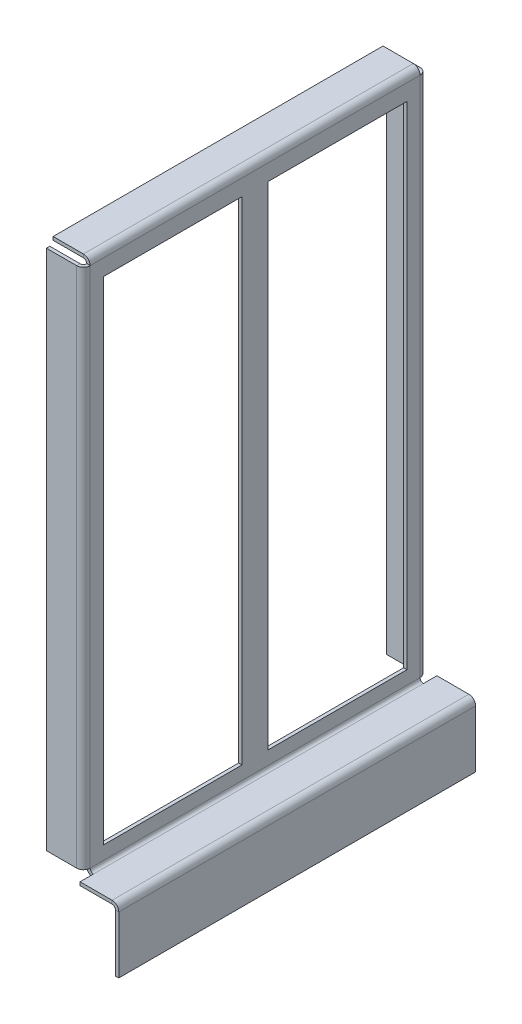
ISO-10303-21;
HEADER;
FILE_DESCRIPTION(('STEP AP214'),'2;1');
FILE_NAME('part.step','',(''),(''),'','','');
FILE_SCHEMA(('AUTOMOTIVE_DESIGN { 1 0 10303 214 1 1 1 1 }'));
ENDSEC;
DATA;
#1=APPLICATION_CONTEXT('core data for automotive mechanical design processes');
#2=APPLICATION_PROTOCOL_DEFINITION('international standard','automotive_design',2000,#1);
#3=PRODUCT_CONTEXT('',#1,'mechanical');
#4=PRODUCT('Part','Part','',(#3));
#5=PRODUCT_RELATED_PRODUCT_CATEGORY('part','',(#4));
#6=PRODUCT_DEFINITION_FORMATION('','',#4);
#7=PRODUCT_DEFINITION_CONTEXT('part definition',#1,'design');
#8=PRODUCT_DEFINITION('design','',#6,#7);
#9=PRODUCT_DEFINITION_SHAPE('','',#8);
#10=(LENGTH_UNIT() NAMED_UNIT(*) SI_UNIT(.MILLI.,.METRE.));
#11=(NAMED_UNIT(*) PLANE_ANGLE_UNIT() SI_UNIT($,.RADIAN.));
#12=(NAMED_UNIT(*) SI_UNIT($,.STERADIAN.) SOLID_ANGLE_UNIT());
#13=UNCERTAINTY_MEASURE_WITH_UNIT(LENGTH_MEASURE(1.E-05),#10,'distance_accuracy_value','');
#14=(GEOMETRIC_REPRESENTATION_CONTEXT(3) GLOBAL_UNCERTAINTY_ASSIGNED_CONTEXT((#13)) GLOBAL_UNIT_ASSIGNED_CONTEXT((#10,
#11,#12)) REPRESENTATION_CONTEXT('',''));
#15=CARTESIAN_POINT('',(0.,0.,0.));
#16=DIRECTION('',(0.,0.,1.));
#17=DIRECTION('',(1.,0.,0.));
#18=AXIS2_PLACEMENT_3D('',#15,#16,#17);
#19=CARTESIAN_POINT('',(-115.234788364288,-78.1922776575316,0.));
#20=DIRECTION('',(0.,-1.,0.));
#21=DIRECTION('',(1.,0.,0.));
#22=AXIS2_PLACEMENT_3D('',#19,#20,#21);
#23=PLANE('',#22);
#24=DIRECTION('',(1.,0.,0.));
#25=VECTOR('',#24,1.);
#26=CARTESIAN_POINT('',(-35.6844134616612,-78.192277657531,101.));
#27=LINE('',#26,#25);
#28=CARTESIAN_POINT('',(-35.6844134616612,-78.192277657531,101.));
#29=VERTEX_POINT('',#28);
#30=CARTESIAN_POINT('',(-26.1825107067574,-78.192277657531,101.));
#31=VERTEX_POINT('',#30);
#32=EDGE_CURVE('E155',#29,#31,#27,.T.);
#33=ORIENTED_EDGE('',*,*,#32,.T.);
#34=DIRECTION('',(0.,0.,-1.));
#35=VECTOR('',#34,1.);
#36=CARTESIAN_POINT('',(-26.1825107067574,-78.192277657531,0.));
#37=LINE('',#36,#35);
#38=CARTESIAN_POINT('',(-26.1825107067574,-78.192277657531,-5.00000000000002));
#39=VERTEX_POINT('',#38);
#40=EDGE_CURVE('E147',#31,#39,#37,.T.);
#41=ORIENTED_EDGE('',*,*,#40,.T.);
#42=DIRECTION('',(-1.,0.,0.));
#43=VECTOR('',#42,1.);
#44=CARTESIAN_POINT('',(-35.6844134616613,-78.192277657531,-5.00000000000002));
#45=LINE('',#44,#43);
#46=CARTESIAN_POINT('',(-35.6844134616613,-78.192277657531,-5.00000000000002));
#47=VERTEX_POINT('',#46);
#48=EDGE_CURVE('E163',#39,#47,#45,.T.);
#49=ORIENTED_EDGE('',*,*,#48,.T.);
#50=DIRECTION('',(0.,0.,1.));
#51=VECTOR('',#50,1.);
#52=CARTESIAN_POINT('',(-35.6844134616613,-78.192277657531,-1.00000000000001));
#53=LINE('',#52,#51);
#54=CARTESIAN_POINT('',(-35.6844134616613,-78.192277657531,-1.00000000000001));
#55=VERTEX_POINT('',#54);
#56=EDGE_CURVE('E499',#47,#55,#53,.T.);
#57=ORIENTED_EDGE('',*,*,#56,.T.);
#58=DIRECTION('',(-1.,0.,0.));
#59=VECTOR('',#58,1.);
#60=CARTESIAN_POINT('',(-38.0444134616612,-78.192277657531,-1.00000000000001));
#61=LINE('',#60,#59);
#62=CARTESIAN_POINT('',(-35.6863162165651,-78.192277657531,-1.00000000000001));
#63=VERTEX_POINT('',#62);
#64=EDGE_CURVE('E497',#55,#63,#61,.T.);
#65=ORIENTED_EDGE('',*,*,#64,.T.);
#66=DIRECTION('',(0.,0.,-1.));
#67=VECTOR('',#66,1.);
#68=CARTESIAN_POINT('',(-35.6863162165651,-78.192277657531,0.));
#69=LINE('',#68,#67);
#70=CARTESIAN_POINT('',(-35.6863162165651,-78.192277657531,97.));
#71=VERTEX_POINT('',#70);
#72=EDGE_CURVE('E484',#71,#63,#69,.T.);
#73=ORIENTED_EDGE('',*,*,#72,.F.);
#74=DIRECTION('',(1.,0.,0.));
#75=VECTOR('',#74,1.);
#76=CARTESIAN_POINT('',(-38.0444134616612,-78.192277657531,97.));
#77=LINE('',#76,#75);
#78=CARTESIAN_POINT('',(-35.6844134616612,-78.192277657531,97.));
#79=VERTEX_POINT('',#78);
#80=EDGE_CURVE('E504',#71,#79,#77,.T.);
#81=ORIENTED_EDGE('',*,*,#80,.T.);
#82=DIRECTION('',(0.,0.,1.));
#83=VECTOR('',#82,1.);
#84=CARTESIAN_POINT('',(-35.6844134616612,-78.192277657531,97.));
#85=LINE('',#84,#83);
#86=EDGE_CURVE('E502',#79,#29,#85,.T.);
#87=ORIENTED_EDGE('',*,*,#86,.T.);
#88=EDGE_LOOP('',(#33,#41,#49,#57,#65,#73,#81,#87));
#89=FACE_BOUND('',#88,.T.);
#90=ADVANCED_FACE('F138',(#89),#23,.F.);
#91=CARTESIAN_POINT('',(-36.6863162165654,-1.31952872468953E-13,0.));
#92=DIRECTION('',(-1.,0.,0.));
#93=DIRECTION('',(0.,-1.,0.));
#94=AXIS2_PLACEMENT_3D('',#91,#92,#93);
#95=PLANE('',#94);
#96=DIRECTION('',(0.,0.,-1.));
#97=VECTOR('',#96,1.);
#98=CARTESIAN_POINT('',(-36.6863162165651,-73.1903749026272,93.1));
#99=LINE('',#98,#97);
#100=CARTESIAN_POINT('',(-36.6863162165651,-73.1903749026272,93.1));
#101=VERTEX_POINT('',#100);
#102=CARTESIAN_POINT('',(-36.6863162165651,-73.1903749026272,51.9));
#103=VERTEX_POINT('',#102);
#104=EDGE_CURVE('E700',#101,#103,#99,.T.);
#105=ORIENTED_EDGE('',*,*,#104,.F.);
#106=DIRECTION('',(0.,-1.,0.));
#107=VECTOR('',#106,1.);
#108=CARTESIAN_POINT('',(-36.6863162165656,73.0096250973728,93.1));
#109=LINE('',#108,#107);
#110=CARTESIAN_POINT('',(-36.6863162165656,73.0096250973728,93.1));
#111=VERTEX_POINT('',#110);
#112=EDGE_CURVE('E678',#111,#101,#109,.T.);
#113=ORIENTED_EDGE('',*,*,#112,.F.);
#114=DIRECTION('',(0.,0.,1.));
#115=VECTOR('',#114,1.);
#116=CARTESIAN_POINT('',(-36.6863162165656,73.0096250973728,93.1));
#117=LINE('',#116,#115);
#118=CARTESIAN_POINT('',(-36.6863162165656,73.0096250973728,51.9));
#119=VERTEX_POINT('',#118);
#120=EDGE_CURVE('E689',#119,#111,#117,.T.);
#121=ORIENTED_EDGE('',*,*,#120,.F.);
#122=DIRECTION('',(0.,1.,0.));
#123=VECTOR('',#122,1.);
#124=CARTESIAN_POINT('',(-36.6863162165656,73.0096250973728,51.9));
#125=LINE('',#124,#123);
#126=EDGE_CURVE('E703',#103,#119,#125,.T.);
#127=ORIENTED_EDGE('',*,*,#126,.F.);
#128=EDGE_LOOP('',(#105,#113,#121,#127));
#129=FACE_BOUND('',#128,.T.);
#130=DIRECTION('',(0.,0.,1.));
#131=VECTOR('',#130,1.);
#132=CARTESIAN_POINT('',(-36.6863162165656,73.0096250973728,2.9));
#133=LINE('',#132,#131);
#134=CARTESIAN_POINT('',(-36.6863162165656,73.0096250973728,2.9));
#135=VERTEX_POINT('',#134);
#136=CARTESIAN_POINT('',(-36.6863162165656,73.0096250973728,44.1));
#137=VERTEX_POINT('',#136);
#138=EDGE_CURVE('E668',#135,#137,#133,.T.);
#139=ORIENTED_EDGE('',*,*,#138,.F.);
#140=DIRECTION('',(0.,1.,0.));
#141=VECTOR('',#140,1.);
#142=CARTESIAN_POINT('',(-36.6863162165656,73.0096250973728,2.9));
#143=LINE('',#142,#141);
#144=CARTESIAN_POINT('',(-36.6863162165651,-73.1903749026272,2.89999999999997));
#145=VERTEX_POINT('',#144);
#146=EDGE_CURVE('E650',#145,#135,#143,.T.);
#147=ORIENTED_EDGE('',*,*,#146,.F.);
#148=DIRECTION('',(0.,0.,-1.));
#149=VECTOR('',#148,1.);
#150=CARTESIAN_POINT('',(-36.6863162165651,-73.1903749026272,2.89999999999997));
#151=LINE('',#150,#149);
#152=CARTESIAN_POINT('',(-36.6863162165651,-73.1903749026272,44.1));
#153=VERTEX_POINT('',#152);
#154=EDGE_CURVE('E657',#153,#145,#151,.T.);
#155=ORIENTED_EDGE('',*,*,#154,.F.);
#156=DIRECTION('',(0.,-1.,0.));
#157=VECTOR('',#156,1.);
#158=CARTESIAN_POINT('',(-36.6863162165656,73.0096250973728,44.1));
#159=LINE('',#158,#157);
#160=EDGE_CURVE('E671',#137,#153,#159,.T.);
#161=ORIENTED_EDGE('',*,*,#160,.F.);
#162=EDGE_LOOP('',(#139,#147,#155,#161));
#163=FACE_BOUND('',#162,.T.);
#164=DIRECTION('',(0.,-1.,0.));
#165=VECTOR('',#164,1.);
#166=CARTESIAN_POINT('',(-36.6863162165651,-77.1903749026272,97.));
#167=LINE('',#166,#165);
#168=CARTESIAN_POINT('',(-36.6863162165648,-77.1903749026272,97.));
#169=VERTEX_POINT('',#168);
#170=CARTESIAN_POINT('',(-36.6863162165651,-77.1922776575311,97.));
#171=VERTEX_POINT('',#170);
#172=EDGE_CURVE('E536',#169,#171,#167,.T.);
#173=ORIENTED_EDGE('',*,*,#172,.T.);
#174=DIRECTION('',(0.,0.,-1.));
#175=VECTOR('',#174,1.);
#176=CARTESIAN_POINT('',(-36.6863162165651,-77.1922776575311,0.));
#177=LINE('',#176,#175);
#178=CARTESIAN_POINT('',(-36.6863162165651,-77.1922776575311,-1.00000000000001));
#179=VERTEX_POINT('',#178);
#180=EDGE_CURVE('E725',#171,#179,#177,.T.);
#181=ORIENTED_EDGE('',*,*,#180,.T.);
#182=DIRECTION('',(0.,1.,0.));
#183=VECTOR('',#182,1.);
#184=CARTESIAN_POINT('',(-36.6863162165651,-77.1903749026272,-1.00000000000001));
#185=LINE('',#184,#183);
#186=CARTESIAN_POINT('',(-36.6863162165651,-77.1903749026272,-1.00000000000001));
#187=VERTEX_POINT('',#186);
#188=EDGE_CURVE('E734',#179,#187,#185,.T.);
#189=ORIENTED_EDGE('',*,*,#188,.T.);
#190=DIRECTION('',(0.,-1.,0.));
#191=VECTOR('',#190,1.);
#192=CARTESIAN_POINT('',(-36.6863162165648,-77.1903749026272,-1.00000000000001));
#193=LINE('',#192,#191);
#194=CARTESIAN_POINT('',(-36.6863162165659,77.8096250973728,-0.999999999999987));
#195=VERTEX_POINT('',#194);
#196=EDGE_CURVE('E574',#187,#195,#193,.F.);
#197=ORIENTED_EDGE('',*,*,#196,.T.);
#198=DIRECTION('',(0.,0.,-1.));
#199=VECTOR('',#198,1.);
#200=CARTESIAN_POINT('',(-36.6863162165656,77.8096250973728,0.));
#201=LINE('',#200,#199);
#202=CARTESIAN_POINT('',(-36.6863162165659,77.8096250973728,97.));
#203=VERTEX_POINT('',#202);
#204=EDGE_CURVE('E393',#195,#203,#201,.F.);
#205=ORIENTED_EDGE('',*,*,#204,.T.);
#206=DIRECTION('',(0.,1.,0.));
#207=VECTOR('',#206,1.);
#208=CARTESIAN_POINT('',(-36.6863162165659,77.8096250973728,97.));
#209=LINE('',#208,#207);
#210=EDGE_CURVE('E630',#203,#169,#209,.F.);
#211=ORIENTED_EDGE('',*,*,#210,.T.);
#212=EDGE_LOOP('',(#173,#181,#189,#197,#205,#211));
#213=FACE_BOUND('',#212,.T.);
#214=ADVANCED_FACE('F770',(#129,#163,#213),#95,.F.);
#215=CARTESIAN_POINT('',(-37.6863162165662,73.0096250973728,51.9));
#216=DIRECTION('',(0.,0.,-1.));
#217=DIRECTION('',(0.,1.,0.));
#218=AXIS2_PLACEMENT_3D('',#215,#216,#217);
#219=PLANE('',#218);
#220=ORIENTED_EDGE('',*,*,#126,.T.);
#221=DIRECTION('',(1.,0.,0.));
#222=VECTOR('',#221,1.);
#223=CARTESIAN_POINT('',(-37.6863162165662,73.0096250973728,51.9));
#224=LINE('',#223,#222);
#225=CARTESIAN_POINT('',(-37.6863162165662,73.0096250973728,51.9));
#226=VERTEX_POINT('',#225);
#227=EDGE_CURVE('E710',#226,#119,#224,.T.);
#228=ORIENTED_EDGE('',*,*,#227,.F.);
#229=DIRECTION('',(0.,1.,0.));
#230=VECTOR('',#229,1.);
#231=CARTESIAN_POINT('',(-37.6863162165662,73.0096250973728,51.9));
#232=LINE('',#231,#230);
#233=CARTESIAN_POINT('',(-37.6863162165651,-73.1903749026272,51.9));
#234=VERTEX_POINT('',#233);
#235=EDGE_CURVE('E692',#234,#226,#232,.T.);
#236=ORIENTED_EDGE('',*,*,#235,.F.);
#237=DIRECTION('',(1.,0.,0.));
#238=VECTOR('',#237,1.);
#239=CARTESIAN_POINT('',(-37.6863162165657,-73.1903749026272,51.9));
#240=LINE('',#239,#238);
#241=EDGE_CURVE('E712',#234,#103,#240,.T.);
#242=ORIENTED_EDGE('',*,*,#241,.T.);
#243=EDGE_LOOP('',(#220,#228,#236,#242));
#244=FACE_BOUND('',#243,.T.);
#245=ADVANCED_FACE('F837',(#244),#219,.F.);
#246=CARTESIAN_POINT('',(-37.6863162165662,73.0096250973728,93.1));
#247=DIRECTION('',(0.,1.,0.));
#248=DIRECTION('',(-1.,0.,0.));
#249=AXIS2_PLACEMENT_3D('',#246,#247,#248);
#250=PLANE('',#249);
#251=ORIENTED_EDGE('',*,*,#120,.T.);
#252=DIRECTION('',(1.,0.,0.));
#253=VECTOR('',#252,1.);
#254=CARTESIAN_POINT('',(-37.6863162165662,73.0096250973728,93.1));
#255=LINE('',#254,#253);
#256=CARTESIAN_POINT('',(-37.6863162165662,73.0096250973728,93.1));
#257=VERTEX_POINT('',#256);
#258=EDGE_CURVE('E708',#257,#111,#255,.T.);
#259=ORIENTED_EDGE('',*,*,#258,.F.);
#260=DIRECTION('',(0.,0.,1.));
#261=VECTOR('',#260,1.);
#262=CARTESIAN_POINT('',(-37.6863162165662,73.0096250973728,93.1));
#263=LINE('',#262,#261);
#264=EDGE_CURVE('E695',#226,#257,#263,.T.);
#265=ORIENTED_EDGE('',*,*,#264,.F.);
#266=ORIENTED_EDGE('',*,*,#227,.T.);
#267=EDGE_LOOP('',(#251,#259,#265,#266));
#268=FACE_BOUND('',#267,.T.);
#269=ADVANCED_FACE('F859',(#268),#250,.F.);
#270=CARTESIAN_POINT('',(-37.6863162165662,73.0096250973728,93.1));
#271=DIRECTION('',(0.,0.,1.));
#272=DIRECTION('',(0.,-1.,0.));
#273=AXIS2_PLACEMENT_3D('',#270,#271,#272);
#274=PLANE('',#273);
#275=ORIENTED_EDGE('',*,*,#112,.T.);
#276=DIRECTION('',(1.,0.,0.));
#277=VECTOR('',#276,1.);
#278=CARTESIAN_POINT('',(-37.6863162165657,-73.1903749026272,93.1));
#279=LINE('',#278,#277);
#280=CARTESIAN_POINT('',(-37.6863162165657,-73.1903749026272,93.1));
#281=VERTEX_POINT('',#280);
#282=EDGE_CURVE('E698',#281,#101,#279,.T.);
#283=ORIENTED_EDGE('',*,*,#282,.F.);
#284=DIRECTION('',(0.,-1.,0.));
#285=VECTOR('',#284,1.);
#286=CARTESIAN_POINT('',(-37.6863162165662,73.0096250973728,93.1));
#287=LINE('',#286,#285);
#288=EDGE_CURVE('E685',#257,#281,#287,.T.);
#289=ORIENTED_EDGE('',*,*,#288,.F.);
#290=ORIENTED_EDGE('',*,*,#258,.T.);
#291=EDGE_LOOP('',(#275,#283,#289,#290));
#292=FACE_BOUND('',#291,.T.);
#293=ADVANCED_FACE('F855',(#292),#274,.F.);
#294=CARTESIAN_POINT('',(-37.6863162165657,-73.1903749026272,93.1));
#295=DIRECTION('',(0.,-1.,0.));
#296=DIRECTION('',(1.,0.,0.));
#297=AXIS2_PLACEMENT_3D('',#294,#295,#296);
#298=PLANE('',#297);
#299=ORIENTED_EDGE('',*,*,#104,.T.);
#300=ORIENTED_EDGE('',*,*,#241,.F.);
#301=DIRECTION('',(0.,0.,-1.));
#302=VECTOR('',#301,1.);
#303=CARTESIAN_POINT('',(-37.6863162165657,-73.1903749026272,93.1));
#304=LINE('',#303,#302);
#305=EDGE_CURVE('E688',#281,#234,#304,.T.);
#306=ORIENTED_EDGE('',*,*,#305,.F.);
#307=ORIENTED_EDGE('',*,*,#282,.T.);
#308=EDGE_LOOP('',(#299,#300,#306,#307));
#309=FACE_BOUND('',#308,.T.);
#310=ADVANCED_FACE('F858',(#309),#298,.F.);
#311=CARTESIAN_POINT('',(-37.6863162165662,73.0096250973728,44.1));
#312=DIRECTION('',(0.,0.,1.));
#313=DIRECTION('',(0.,-1.,0.));
#314=AXIS2_PLACEMENT_3D('',#311,#312,#313);
#315=PLANE('',#314);
#316=ORIENTED_EDGE('',*,*,#160,.T.);
#317=DIRECTION('',(1.,0.,0.));
#318=VECTOR('',#317,1.);
#319=CARTESIAN_POINT('',(-37.6863162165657,-73.1903749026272,44.1));
#320=LINE('',#319,#318);
#321=CARTESIAN_POINT('',(-37.6863162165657,-73.1903749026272,44.1));
#322=VERTEX_POINT('',#321);
#323=EDGE_CURVE('E679',#322,#153,#320,.T.);
#324=ORIENTED_EDGE('',*,*,#323,.F.);
#325=DIRECTION('',(0.,-1.,0.));
#326=VECTOR('',#325,1.);
#327=CARTESIAN_POINT('',(-37.6863162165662,73.0096250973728,44.1));
#328=LINE('',#327,#326);
#329=CARTESIAN_POINT('',(-37.6863162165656,73.0096250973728,44.1));
#330=VERTEX_POINT('',#329);
#331=EDGE_CURVE('E660',#330,#322,#328,.T.);
#332=ORIENTED_EDGE('',*,*,#331,.F.);
#333=DIRECTION('',(1.,0.,0.));
#334=VECTOR('',#333,1.);
#335=CARTESIAN_POINT('',(-37.6863162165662,73.0096250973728,44.1));
#336=LINE('',#335,#334);
#337=EDGE_CURVE('E681',#330,#137,#336,.T.);
#338=ORIENTED_EDGE('',*,*,#337,.T.);
#339=EDGE_LOOP('',(#316,#324,#332,#338));
#340=FACE_BOUND('',#339,.T.);
#341=ADVANCED_FACE('F863',(#340),#315,.F.);
#342=CARTESIAN_POINT('',(-37.6863162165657,-73.1903749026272,2.89999999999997));
#343=DIRECTION('',(0.,-1.,0.));
#344=DIRECTION('',(1.,0.,0.));
#345=AXIS2_PLACEMENT_3D('',#342,#343,#344);
#346=PLANE('',#345);
#347=ORIENTED_EDGE('',*,*,#154,.T.);
#348=DIRECTION('',(1.,0.,0.));
#349=VECTOR('',#348,1.);
#350=CARTESIAN_POINT('',(-37.6863162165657,-73.1903749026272,2.89999999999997));
#351=LINE('',#350,#349);
#352=CARTESIAN_POINT('',(-37.6863162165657,-73.1903749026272,2.89999999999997));
#353=VERTEX_POINT('',#352);
#354=EDGE_CURVE('E676',#353,#145,#351,.T.);
#355=ORIENTED_EDGE('',*,*,#354,.F.);
#356=DIRECTION('',(0.,0.,-1.));
#357=VECTOR('',#356,1.);
#358=CARTESIAN_POINT('',(-37.6863162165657,-73.1903749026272,2.89999999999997));
#359=LINE('',#358,#357);
#360=EDGE_CURVE('E663',#322,#353,#359,.T.);
#361=ORIENTED_EDGE('',*,*,#360,.F.);
#362=ORIENTED_EDGE('',*,*,#323,.T.);
#363=EDGE_LOOP('',(#347,#355,#361,#362));
#364=FACE_BOUND('',#363,.T.);
#365=ADVANCED_FACE('F874',(#364),#346,.F.);
#366=CARTESIAN_POINT('',(-37.6863162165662,73.0096250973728,2.9));
#367=DIRECTION('',(0.,0.,-1.));
#368=DIRECTION('',(0.,1.,0.));
#369=AXIS2_PLACEMENT_3D('',#366,#367,#368);
#370=PLANE('',#369);
#371=ORIENTED_EDGE('',*,*,#146,.T.);
#372=DIRECTION('',(1.,0.,0.));
#373=VECTOR('',#372,1.);
#374=CARTESIAN_POINT('',(-37.6863162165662,73.0096250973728,2.9));
#375=LINE('',#374,#373);
#376=CARTESIAN_POINT('',(-37.6863162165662,73.0096250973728,2.9));
#377=VERTEX_POINT('',#376);
#378=EDGE_CURVE('E666',#377,#135,#375,.T.);
#379=ORIENTED_EDGE('',*,*,#378,.F.);
#380=DIRECTION('',(0.,1.,0.));
#381=VECTOR('',#380,1.);
#382=CARTESIAN_POINT('',(-37.6863162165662,73.0096250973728,2.9));
#383=LINE('',#382,#381);
#384=EDGE_CURVE('E653',#353,#377,#383,.T.);
#385=ORIENTED_EDGE('',*,*,#384,.F.);
#386=ORIENTED_EDGE('',*,*,#354,.T.);
#387=EDGE_LOOP('',(#371,#379,#385,#386));
#388=FACE_BOUND('',#387,.T.);
#389=ADVANCED_FACE('F871',(#388),#370,.F.);
#390=CARTESIAN_POINT('',(-37.6863162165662,73.0096250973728,2.9));
#391=DIRECTION('',(0.,1.,0.));
#392=DIRECTION('',(-1.,0.,0.));
#393=AXIS2_PLACEMENT_3D('',#390,#391,#392);
#394=PLANE('',#393);
#395=ORIENTED_EDGE('',*,*,#138,.T.);
#396=ORIENTED_EDGE('',*,*,#337,.F.);
#397=DIRECTION('',(0.,0.,1.));
#398=VECTOR('',#397,1.);
#399=CARTESIAN_POINT('',(-37.6863162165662,73.0096250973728,2.9));
#400=LINE('',#399,#398);
#401=EDGE_CURVE('E656',#377,#330,#400,.T.);
#402=ORIENTED_EDGE('',*,*,#401,.F.);
#403=ORIENTED_EDGE('',*,*,#378,.T.);
#404=EDGE_LOOP('',(#395,#396,#402,#403));
#405=FACE_BOUND('',#404,.T.);
#406=ADVANCED_FACE('F854',(#405),#394,.F.);
#407=CARTESIAN_POINT('',(-37.6863162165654,-1.3564879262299E-13,0.));
#408=DIRECTION('',(-1.,0.,0.));
#409=DIRECTION('',(0.,-1.,0.));
#410=AXIS2_PLACEMENT_3D('',#407,#408,#409);
#411=PLANE('',#410);
#412=DIRECTION('',(0.,0.,-1.));
#413=VECTOR('',#412,1.);
#414=CARTESIAN_POINT('',(-37.6863162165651,-77.1922776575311,0.));
#415=LINE('',#414,#413);
#416=CARTESIAN_POINT('',(-37.6863162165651,-77.1922776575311,97.));
#417=VERTEX_POINT('',#416);
#418=CARTESIAN_POINT('',(-37.6863162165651,-77.1922776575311,-1.00000000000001));
#419=VERTEX_POINT('',#418);
#420=EDGE_CURVE('E718',#417,#419,#415,.T.);
#421=ORIENTED_EDGE('',*,*,#420,.F.);
#422=DIRECTION('',(0.,-1.,0.));
#423=VECTOR('',#422,1.);
#424=CARTESIAN_POINT('',(-37.6863162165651,-77.1903749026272,97.));
#425=LINE('',#424,#423);
#426=CARTESIAN_POINT('',(-37.6863162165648,-77.1903749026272,97.));
#427=VERTEX_POINT('',#426);
#428=EDGE_CURVE('E732',#427,#417,#425,.T.);
#429=ORIENTED_EDGE('',*,*,#428,.F.);
#430=DIRECTION('',(0.,1.,0.));
#431=VECTOR('',#430,1.);
#432=CARTESIAN_POINT('',(-37.6863162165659,77.8096250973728,97.));
#433=LINE('',#432,#431);
#434=CARTESIAN_POINT('',(-37.6863162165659,77.8096250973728,97.));
#435=VERTEX_POINT('',#434);
#436=EDGE_CURVE('E643',#435,#427,#433,.F.);
#437=ORIENTED_EDGE('',*,*,#436,.F.);
#438=DIRECTION('',(0.,0.,1.));
#439=VECTOR('',#438,1.);
#440=CARTESIAN_POINT('',(-37.6863162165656,77.8096250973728,95.));
#441=LINE('',#440,#439);
#442=CARTESIAN_POINT('',(-37.6863162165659,77.8096250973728,-0.999999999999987));
#443=VERTEX_POINT('',#442);
#444=EDGE_CURVE('E716',#443,#435,#441,.T.);
#445=ORIENTED_EDGE('',*,*,#444,.F.);
#446=DIRECTION('',(0.,-1.,0.));
#447=VECTOR('',#446,1.);
#448=CARTESIAN_POINT('',(-37.6863162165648,-77.1903749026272,-1.00000000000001));
#449=LINE('',#448,#447);
#450=CARTESIAN_POINT('',(-37.6863162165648,-77.1903749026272,-1.00000000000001));
#451=VERTEX_POINT('',#450);
#452=EDGE_CURVE('E587',#451,#443,#449,.F.);
#453=ORIENTED_EDGE('',*,*,#452,.F.);
#454=DIRECTION('',(0.,1.,0.));
#455=VECTOR('',#454,1.);
#456=CARTESIAN_POINT('',(-37.6863162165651,-77.1903749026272,-1.00000000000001));
#457=LINE('',#456,#455);
#458=EDGE_CURVE('E573',#419,#451,#457,.T.);
#459=ORIENTED_EDGE('',*,*,#458,.F.);
#460=EDGE_LOOP('',(#421,#429,#437,#445,#453,#459));
#461=FACE_BOUND('',#460,.T.);
#462=ORIENTED_EDGE('',*,*,#384,.T.);
#463=ORIENTED_EDGE('',*,*,#401,.T.);
#464=ORIENTED_EDGE('',*,*,#331,.T.);
#465=ORIENTED_EDGE('',*,*,#360,.T.);
#466=EDGE_LOOP('',(#462,#463,#464,#465));
#467=FACE_BOUND('',#466,.T.);
#468=ORIENTED_EDGE('',*,*,#288,.T.);
#469=ORIENTED_EDGE('',*,*,#305,.T.);
#470=ORIENTED_EDGE('',*,*,#235,.T.);
#471=ORIENTED_EDGE('',*,*,#264,.T.);
#472=EDGE_LOOP('',(#468,#469,#470,#471));
#473=FACE_BOUND('',#472,.T.);
#474=ADVANCED_FACE('F786',(#461,#467,#473),#411,.T.);
#475=CARTESIAN_POINT('',(-38.6863162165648,-77.1903749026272,97.));
#476=DIRECTION('',(0.,-1.,0.));
#477=DIRECTION('',(1.,0.,0.));
#478=AXIS2_PLACEMENT_3D('',#475,#476,#477);
#479=PLANE('',#478);
#480=DIRECTION('',(0.,0.,1.));
#481=VECTOR('',#480,1.);
#482=CARTESIAN_POINT('',(-38.6863162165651,-77.1903749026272,99.));
#483=LINE('',#482,#481);
#484=CARTESIAN_POINT('',(-38.6863162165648,-77.1903749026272,98.));
#485=VERTEX_POINT('',#484);
#486=CARTESIAN_POINT('',(-38.6863162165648,-77.1903749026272,99.));
#487=VERTEX_POINT('',#486);
#488=EDGE_CURVE('E595',#485,#487,#483,.T.);
#489=ORIENTED_EDGE('',*,*,#488,.F.);
#490=CARTESIAN_POINT('',(-38.6863162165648,-77.1903749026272,97.));
#491=DIRECTION('',(0.,1.,0.));
#492=DIRECTION('',(-1.,0.,0.));
#493=AXIS2_PLACEMENT_3D('',#490,#491,#492);
#494=CIRCLE('',#493,1.);
#495=EDGE_CURVE('E640',#427,#485,#494,.F.);
#496=ORIENTED_EDGE('',*,*,#495,.F.);
#497=DIRECTION('',(1.,0.,0.));
#498=VECTOR('',#497,1.);
#499=CARTESIAN_POINT('',(-37.6863162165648,-77.1903749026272,97.));
#500=LINE('',#499,#498);
#501=EDGE_CURVE('E647',#427,#169,#500,.T.);
#502=ORIENTED_EDGE('',*,*,#501,.T.);
#503=CARTESIAN_POINT('',(-38.6863162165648,-77.1903749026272,97.));
#504=DIRECTION('',(0.,1.,0.));
#505=DIRECTION('',(-1.,0.,0.));
#506=AXIS2_PLACEMENT_3D('',#503,#504,#505);
#507=CIRCLE('',#506,2.);
#508=EDGE_CURVE('E633',#169,#487,#507,.F.);
#509=ORIENTED_EDGE('',*,*,#508,.T.);
#510=EDGE_LOOP('',(#489,#496,#502,#509));
#511=FACE_BOUND('',#510,.T.);
#512=ADVANCED_FACE('F795',(#511),#479,.T.);
#513=CARTESIAN_POINT('',(-38.6863162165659,77.8096250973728,97.));
#514=DIRECTION('',(0.,-1.,0.));
#515=DIRECTION('',(1.,0.,0.));
#516=AXIS2_PLACEMENT_3D('',#513,#514,#515);
#517=PLANE('',#516);
#518=CARTESIAN_POINT('',(-38.6863162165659,77.8096250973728,97.));
#519=DIRECTION('',(0.,1.,0.));
#520=DIRECTION('',(-1.,0.,0.));
#521=AXIS2_PLACEMENT_3D('',#518,#519,#520);
#522=CIRCLE('',#521,1.);
#523=CARTESIAN_POINT('',(-38.6863162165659,77.8096250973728,98.));
#524=VERTEX_POINT('',#523);
#525=EDGE_CURVE('E600',#524,#435,#522,.T.);
#526=ORIENTED_EDGE('',*,*,#525,.F.);
#527=DIRECTION('',(0.,0.,1.));
#528=VECTOR('',#527,1.);
#529=CARTESIAN_POINT('',(-38.6863162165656,77.8096250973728,98.));
#530=LINE('',#529,#528);
#531=CARTESIAN_POINT('',(-38.6863162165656,77.8096250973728,99.));
#532=VERTEX_POINT('',#531);
#533=EDGE_CURVE('E623',#524,#532,#530,.T.);
#534=ORIENTED_EDGE('',*,*,#533,.T.);
#535=CARTESIAN_POINT('',(-38.6863162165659,77.8096250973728,97.));
#536=DIRECTION('',(0.,1.,0.));
#537=DIRECTION('',(-1.,0.,0.));
#538=AXIS2_PLACEMENT_3D('',#535,#536,#537);
#539=CIRCLE('',#538,2.);
#540=EDGE_CURVE('E634',#532,#203,#539,.T.);
#541=ORIENTED_EDGE('',*,*,#540,.T.);
#542=DIRECTION('',(1.,0.,0.));
#543=VECTOR('',#542,1.);
#544=CARTESIAN_POINT('',(-37.6863162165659,77.8096250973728,97.));
#545=LINE('',#544,#543);
#546=EDGE_CURVE('E637',#435,#203,#545,.T.);
#547=ORIENTED_EDGE('',*,*,#546,.F.);
#548=EDGE_LOOP('',(#526,#534,#541,#547));
#549=FACE_BOUND('',#548,.T.);
#550=ADVANCED_FACE('F802',(#549),#517,.F.);
#551=CARTESIAN_POINT('',(-38.6863162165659,77.8096250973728,97.));
#552=DIRECTION('',(0.,1.,0.));
#553=DIRECTION('',(0.,0.,1.));
#554=AXIS2_PLACEMENT_3D('',#551,#552,#553);
#555=CYLINDRICAL_SURFACE('',#554,2.);
#556=ORIENTED_EDGE('',*,*,#210,.F.);
#557=ORIENTED_EDGE('',*,*,#540,.F.);
#558=DIRECTION('',(0.,1.,0.));
#559=VECTOR('',#558,1.);
#560=CARTESIAN_POINT('',(-38.6863162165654,-1.42013548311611E-13,99.));
#561=LINE('',#560,#559);
#562=EDGE_CURVE('E620',#487,#532,#561,.T.);
#563=ORIENTED_EDGE('',*,*,#562,.F.);
#564=ORIENTED_EDGE('',*,*,#508,.F.);
#565=EDGE_LOOP('',(#556,#557,#563,#564));
#566=FACE_BOUND('',#565,.T.);
#567=ADVANCED_FACE('F798',(#566),#555,.T.);
#568=CARTESIAN_POINT('',(-38.6863162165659,77.8096250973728,97.));
#569=DIRECTION('',(0.,1.,0.));
#570=DIRECTION('',(0.,0.,1.));
#571=AXIS2_PLACEMENT_3D('',#568,#569,#570);
#572=CYLINDRICAL_SURFACE('',#571,1.);
#573=ORIENTED_EDGE('',*,*,#436,.T.);
#574=ORIENTED_EDGE('',*,*,#495,.T.);
#575=DIRECTION('',(0.,-1.,0.));
#576=VECTOR('',#575,1.);
#577=CARTESIAN_POINT('',(-38.6863162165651,-77.1903749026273,98.));
#578=LINE('',#577,#576);
#579=EDGE_CURVE('E626',#485,#524,#578,.F.);
#580=ORIENTED_EDGE('',*,*,#579,.T.);
#581=ORIENTED_EDGE('',*,*,#525,.T.);
#582=EDGE_LOOP('',(#573,#574,#580,#581));
#583=FACE_BOUND('',#582,.T.);
#584=ADVANCED_FACE('F821',(#583),#572,.F.);
#585=CARTESIAN_POINT('',(-37.6863162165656,77.8096250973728,99.));
#586=DIRECTION('',(0.,1.,0.));
#587=DIRECTION('',(-1.,0.,0.));
#588=AXIS2_PLACEMENT_3D('',#585,#586,#587);
#589=PLANE('',#588);
#590=DIRECTION('',(1.,0.,0.));
#591=VECTOR('',#590,1.);
#592=CARTESIAN_POINT('',(-37.6863162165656,77.8096250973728,99.));
#593=LINE('',#592,#591);
#594=CARTESIAN_POINT('',(-47.6863162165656,77.8096250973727,99.));
#595=VERTEX_POINT('',#594);
#596=EDGE_CURVE('E609',#595,#532,#593,.T.);
#597=ORIENTED_EDGE('',*,*,#596,.T.);
#598=ORIENTED_EDGE('',*,*,#533,.F.);
#599=DIRECTION('',(-1.,0.,0.));
#600=VECTOR('',#599,1.);
#601=CARTESIAN_POINT('',(0.,77.8096250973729,97.9999999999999));
#602=LINE('',#601,#600);
#603=CARTESIAN_POINT('',(-47.6863162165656,77.8096250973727,98.));
#604=VERTEX_POINT('',#603);
#605=EDGE_CURVE('E617',#604,#524,#602,.F.);
#606=ORIENTED_EDGE('',*,*,#605,.F.);
#607=DIRECTION('',(0.,0.,-1.));
#608=VECTOR('',#607,1.);
#609=CARTESIAN_POINT('',(-47.6863162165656,77.8096250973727,99.));
#610=LINE('',#609,#608);
#611=EDGE_CURVE('E598',#595,#604,#610,.T.);
#612=ORIENTED_EDGE('',*,*,#611,.F.);
#613=EDGE_LOOP('',(#597,#598,#606,#612));
#614=FACE_BOUND('',#613,.T.);
#615=ADVANCED_FACE('F811',(#614),#589,.T.);
#616=CARTESIAN_POINT('',(-47.6863162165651,-77.1903749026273,99.));
#617=DIRECTION('',(0.,-1.,0.));
#618=DIRECTION('',(1.,0.,0.));
#619=AXIS2_PLACEMENT_3D('',#616,#617,#618);
#620=PLANE('',#619);
#621=DIRECTION('',(1.,0.,0.));
#622=VECTOR('',#621,1.);
#623=CARTESIAN_POINT('',(8.24009610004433E-13,-77.190374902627,97.9999999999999));
#624=LINE('',#623,#622);
#625=CARTESIAN_POINT('',(-47.6863162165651,-77.1903749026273,98.));
#626=VERTEX_POINT('',#625);
#627=EDGE_CURVE('E615',#485,#626,#624,.F.);
#628=ORIENTED_EDGE('',*,*,#627,.F.);
#629=ORIENTED_EDGE('',*,*,#488,.T.);
#630=DIRECTION('',(-1.,0.,0.));
#631=VECTOR('',#630,1.);
#632=CARTESIAN_POINT('',(-47.6863162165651,-77.1903749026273,99.));
#633=LINE('',#632,#631);
#634=CARTESIAN_POINT('',(-47.6863162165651,-77.1903749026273,99.));
#635=VERTEX_POINT('',#634);
#636=EDGE_CURVE('E607',#487,#635,#633,.T.);
#637=ORIENTED_EDGE('',*,*,#636,.T.);
#638=DIRECTION('',(0.,0.,-1.));
#639=VECTOR('',#638,1.);
#640=CARTESIAN_POINT('',(-47.6863162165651,-77.1903749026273,99.));
#641=LINE('',#640,#639);
#642=EDGE_CURVE('E601',#635,#626,#641,.T.);
#643=ORIENTED_EDGE('',*,*,#642,.T.);
#644=EDGE_LOOP('',(#628,#629,#637,#643));
#645=FACE_BOUND('',#644,.T.);
#646=ADVANCED_FACE('F818',(#645),#620,.T.);
#647=CARTESIAN_POINT('',(3.99008433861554E-13,0.,98.9999999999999));
#648=DIRECTION('',(0.,0.,1.));
#649=DIRECTION('',(1.,0.,0.));
#650=AXIS2_PLACEMENT_3D('',#647,#648,#649);
#651=PLANE('',#650);
#652=ORIENTED_EDGE('',*,*,#636,.F.);
#653=ORIENTED_EDGE('',*,*,#562,.T.);
#654=ORIENTED_EDGE('',*,*,#596,.F.);
#655=DIRECTION('',(0.,1.,0.));
#656=VECTOR('',#655,1.);
#657=CARTESIAN_POINT('',(-47.6863162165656,77.8096250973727,99.));
#658=LINE('',#657,#656);
#659=EDGE_CURVE('E604',#635,#595,#658,.T.);
#660=ORIENTED_EDGE('',*,*,#659,.F.);
#661=EDGE_LOOP('',(#652,#653,#654,#660));
#662=FACE_BOUND('',#661,.T.);
#663=ADVANCED_FACE('F809',(#662),#651,.T.);
#664=CARTESIAN_POINT('',(3.95516952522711E-13,0.,97.9999999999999));
#665=DIRECTION('',(0.,0.,1.));
#666=DIRECTION('',(1.,0.,0.));
#667=AXIS2_PLACEMENT_3D('',#664,#665,#666);
#668=PLANE('',#667);
#669=ORIENTED_EDGE('',*,*,#579,.F.);
#670=ORIENTED_EDGE('',*,*,#627,.T.);
#671=DIRECTION('',(0.,-1.,0.));
#672=VECTOR('',#671,1.);
#673=CARTESIAN_POINT('',(-47.6863162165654,-1.75051636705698E-13,98.));
#674=LINE('',#673,#672);
#675=EDGE_CURVE('E612',#626,#604,#674,.F.);
#676=ORIENTED_EDGE('',*,*,#675,.T.);
#677=ORIENTED_EDGE('',*,*,#605,.T.);
#678=EDGE_LOOP('',(#669,#670,#676,#677));
#679=FACE_BOUND('',#678,.T.);
#680=ADVANCED_FACE('F823',(#679),#668,.F.);
#681=CARTESIAN_POINT('',(-47.6863162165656,77.8096250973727,99.));
#682=DIRECTION('',(-1.,0.,0.));
#683=DIRECTION('',(0.,-1.,0.));
#684=AXIS2_PLACEMENT_3D('',#681,#682,#683);
#685=PLANE('',#684);
#686=ORIENTED_EDGE('',*,*,#675,.F.);
#687=ORIENTED_EDGE('',*,*,#642,.F.);
#688=ORIENTED_EDGE('',*,*,#659,.T.);
#689=ORIENTED_EDGE('',*,*,#611,.T.);
#690=EDGE_LOOP('',(#686,#687,#688,#689));
#691=FACE_BOUND('',#690,.T.);
#692=ADVANCED_FACE('F814',(#691),#685,.T.);
#693=CARTESIAN_POINT('',(-38.6863162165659,77.8096250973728,-0.999999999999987));
#694=DIRECTION('',(0.,1.,0.));
#695=DIRECTION('',(-1.,0.,0.));
#696=AXIS2_PLACEMENT_3D('',#693,#694,#695);
#697=PLANE('',#696);
#698=DIRECTION('',(0.,0.,-1.));
#699=VECTOR('',#698,1.);
#700=CARTESIAN_POINT('',(-38.6863162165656,77.8096250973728,-2.99999999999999));
#701=LINE('',#700,#699);
#702=CARTESIAN_POINT('',(-38.6863162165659,77.8096250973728,-1.99999999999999));
#703=VERTEX_POINT('',#702);
#704=CARTESIAN_POINT('',(-38.6863162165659,77.8096250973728,-2.99999999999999));
#705=VERTEX_POINT('',#704);
#706=EDGE_CURVE('E570',#703,#705,#701,.T.);
#707=ORIENTED_EDGE('',*,*,#706,.F.);
#708=CARTESIAN_POINT('',(-38.6863162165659,77.8096250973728,-0.999999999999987));
#709=DIRECTION('',(0.,-1.,0.));
#710=DIRECTION('',(1.,0.,0.));
#711=AXIS2_PLACEMENT_3D('',#708,#709,#710);
#712=CIRCLE('',#711,1.);
#713=EDGE_CURVE('E584',#443,#703,#712,.F.);
#714=ORIENTED_EDGE('',*,*,#713,.F.);
#715=DIRECTION('',(1.,0.,0.));
#716=VECTOR('',#715,1.);
#717=CARTESIAN_POINT('',(-37.6863162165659,77.8096250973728,-0.999999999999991));
#718=LINE('',#717,#716);
#719=EDGE_CURVE('E592',#443,#195,#718,.T.);
#720=ORIENTED_EDGE('',*,*,#719,.T.);
#721=CARTESIAN_POINT('',(-38.6863162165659,77.8096250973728,-0.999999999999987));
#722=DIRECTION('',(0.,-1.,0.));
#723=DIRECTION('',(1.,0.,0.));
#724=AXIS2_PLACEMENT_3D('',#721,#722,#723);
#725=CIRCLE('',#724,2.);
#726=EDGE_CURVE('E577',#195,#705,#725,.F.);
#727=ORIENTED_EDGE('',*,*,#726,.T.);
#728=EDGE_LOOP('',(#707,#714,#720,#727));
#729=FACE_BOUND('',#728,.T.);
#730=ADVANCED_FACE('F830',(#729),#697,.T.);
#731=CARTESIAN_POINT('',(-38.6863162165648,-77.1903749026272,-1.));
#732=DIRECTION('',(0.,1.,0.));
#733=DIRECTION('',(-1.,0.,0.));
#734=AXIS2_PLACEMENT_3D('',#731,#732,#733);
#735=PLANE('',#734);
#736=CARTESIAN_POINT('',(-38.6863162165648,-77.1903749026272,-1.));
#737=DIRECTION('',(0.,-1.,0.));
#738=DIRECTION('',(1.,0.,0.));
#739=AXIS2_PLACEMENT_3D('',#736,#737,#738);
#740=CIRCLE('',#739,1.);
#741=CARTESIAN_POINT('',(-38.6863162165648,-77.1903749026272,-2.00000000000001));
#742=VERTEX_POINT('',#741);
#743=EDGE_CURVE('E543',#742,#451,#740,.T.);
#744=ORIENTED_EDGE('',*,*,#743,.F.);
#745=DIRECTION('',(0.,0.,-1.));
#746=VECTOR('',#745,1.);
#747=CARTESIAN_POINT('',(-38.6863162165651,-77.1903749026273,-2.));
#748=LINE('',#747,#746);
#749=CARTESIAN_POINT('',(-38.6863162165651,-77.1903749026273,-3.));
#750=VERTEX_POINT('',#749);
#751=EDGE_CURVE('E565',#742,#750,#748,.T.);
#752=ORIENTED_EDGE('',*,*,#751,.T.);
#753=CARTESIAN_POINT('',(-38.6863162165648,-77.1903749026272,-1.));
#754=DIRECTION('',(0.,-1.,0.));
#755=DIRECTION('',(1.,0.,0.));
#756=AXIS2_PLACEMENT_3D('',#753,#754,#755);
#757=CIRCLE('',#756,2.);
#758=EDGE_CURVE('E578',#750,#187,#757,.T.);
#759=ORIENTED_EDGE('',*,*,#758,.T.);
#760=DIRECTION('',(1.,0.,0.));
#761=VECTOR('',#760,1.);
#762=CARTESIAN_POINT('',(-37.6863162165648,-77.1903749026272,-1.00000000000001));
#763=LINE('',#762,#761);
#764=EDGE_CURVE('E581',#451,#187,#763,.T.);
#765=ORIENTED_EDGE('',*,*,#764,.F.);
#766=EDGE_LOOP('',(#744,#752,#759,#765));
#767=FACE_BOUND('',#766,.T.);
#768=ADVANCED_FACE('F991',(#767),#735,.F.);
#769=CARTESIAN_POINT('',(-38.6863162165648,-77.1903749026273,-1.));
#770=DIRECTION('',(0.,-1.,0.));
#771=DIRECTION('',(0.,0.,-1.));
#772=AXIS2_PLACEMENT_3D('',#769,#770,#771);
#773=CYLINDRICAL_SURFACE('',#772,2.);
#774=ORIENTED_EDGE('',*,*,#196,.F.);
#775=ORIENTED_EDGE('',*,*,#758,.F.);
#776=DIRECTION('',(0.,-1.,0.));
#777=VECTOR('',#776,1.);
#778=CARTESIAN_POINT('',(-38.6863162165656,77.8096250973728,-2.99999999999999));
#779=LINE('',#778,#777);
#780=EDGE_CURVE('E563',#750,#705,#779,.F.);
#781=ORIENTED_EDGE('',*,*,#780,.T.);
#782=ORIENTED_EDGE('',*,*,#726,.F.);
#783=EDGE_LOOP('',(#774,#775,#781,#782));
#784=FACE_BOUND('',#783,.T.);
#785=ADVANCED_FACE('F996',(#784),#773,.T.);
#786=CARTESIAN_POINT('',(-38.6863162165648,-77.1903749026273,-1.));
#787=DIRECTION('',(0.,-1.,0.));
#788=DIRECTION('',(0.,0.,-1.));
#789=AXIS2_PLACEMENT_3D('',#786,#787,#788);
#790=CYLINDRICAL_SURFACE('',#789,1.);
#791=ORIENTED_EDGE('',*,*,#452,.T.);
#792=ORIENTED_EDGE('',*,*,#713,.T.);
#793=DIRECTION('',(0.,-1.,0.));
#794=VECTOR('',#793,1.);
#795=CARTESIAN_POINT('',(-38.6863162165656,77.8096250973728,-1.99999999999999));
#796=LINE('',#795,#794);
#797=EDGE_CURVE('E568',#703,#742,#796,.T.);
#798=ORIENTED_EDGE('',*,*,#797,.T.);
#799=ORIENTED_EDGE('',*,*,#743,.T.);
#800=EDGE_LOOP('',(#791,#792,#798,#799));
#801=FACE_BOUND('',#800,.T.);
#802=ADVANCED_FACE('F930',(#801),#790,.F.);
#803=CARTESIAN_POINT('',(-47.6863162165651,-77.1903749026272,-3.00000000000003));
#804=DIRECTION('',(0.,-1.,0.));
#805=DIRECTION('',(1.,0.,0.));
#806=AXIS2_PLACEMENT_3D('',#803,#804,#805);
#807=PLANE('',#806);
#808=DIRECTION('',(-1.,0.,0.));
#809=VECTOR('',#808,1.);
#810=CARTESIAN_POINT('',(-47.6863162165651,-77.1903749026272,-3.00000000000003));
#811=LINE('',#810,#809);
#812=CARTESIAN_POINT('',(-47.6863162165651,-77.1903749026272,-3.00000000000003));
#813=VERTEX_POINT('',#812);
#814=EDGE_CURVE('E547',#813,#750,#811,.F.);
#815=ORIENTED_EDGE('',*,*,#814,.T.);
#816=ORIENTED_EDGE('',*,*,#751,.F.);
#817=DIRECTION('',(1.,0.,0.));
#818=VECTOR('',#817,1.);
#819=CARTESIAN_POINT('',(1.03632033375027E-13,-77.1903749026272,-1.99999999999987));
#820=LINE('',#819,#818);
#821=CARTESIAN_POINT('',(-47.6863162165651,-77.1903749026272,-2.00000000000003));
#822=VERTEX_POINT('',#821);
#823=EDGE_CURVE('E555',#822,#742,#820,.T.);
#824=ORIENTED_EDGE('',*,*,#823,.F.);
#825=DIRECTION('',(0.,0.,1.));
#826=VECTOR('',#825,1.);
#827=CARTESIAN_POINT('',(-47.6863162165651,-77.1903749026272,-3.00000000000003));
#828=LINE('',#827,#826);
#829=EDGE_CURVE('E541',#813,#822,#828,.T.);
#830=ORIENTED_EDGE('',*,*,#829,.F.);
#831=EDGE_LOOP('',(#815,#816,#824,#830));
#832=FACE_BOUND('',#831,.T.);
#833=ADVANCED_FACE('F924',(#832),#807,.T.);
#834=CARTESIAN_POINT('',(-37.6863162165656,77.8096250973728,-2.99999999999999));
#835=DIRECTION('',(0.,1.,0.));
#836=DIRECTION('',(-1.,0.,0.));
#837=AXIS2_PLACEMENT_3D('',#834,#835,#836);
#838=PLANE('',#837);
#839=DIRECTION('',(-1.,0.,0.));
#840=VECTOR('',#839,1.);
#841=CARTESIAN_POINT('',(-3.27438770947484E-13,77.8096250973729,-1.99999999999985));
#842=LINE('',#841,#840);
#843=CARTESIAN_POINT('',(-47.6863162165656,77.8096250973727,-2.00000000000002));
#844=VERTEX_POINT('',#843);
#845=EDGE_CURVE('E561',#703,#844,#842,.T.);
#846=ORIENTED_EDGE('',*,*,#845,.F.);
#847=ORIENTED_EDGE('',*,*,#706,.T.);
#848=DIRECTION('',(1.,0.,0.));
#849=VECTOR('',#848,1.);
#850=CARTESIAN_POINT('',(-37.6863162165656,77.8096250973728,-2.99999999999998));
#851=LINE('',#850,#849);
#852=CARTESIAN_POINT('',(-47.6863162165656,77.8096250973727,-3.00000000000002));
#853=VERTEX_POINT('',#852);
#854=EDGE_CURVE('E553',#705,#853,#851,.F.);
#855=ORIENTED_EDGE('',*,*,#854,.T.);
#856=DIRECTION('',(0.,0.,1.));
#857=VECTOR('',#856,1.);
#858=CARTESIAN_POINT('',(-47.6863162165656,77.8096250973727,-3.00000000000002));
#859=LINE('',#858,#857);
#860=EDGE_CURVE('E544',#853,#844,#859,.T.);
#861=ORIENTED_EDGE('',*,*,#860,.T.);
#862=EDGE_LOOP('',(#846,#847,#855,#861));
#863=FACE_BOUND('',#862,.T.);
#864=ADVANCED_FACE('F929',(#863),#838,.T.);
#865=CARTESIAN_POINT('',(0.,0.,-2.99999999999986));
#866=DIRECTION('',(0.,0.,1.));
#867=DIRECTION('',(1.,0.,0.));
#868=AXIS2_PLACEMENT_3D('',#865,#866,#867);
#869=PLANE('',#868);
#870=ORIENTED_EDGE('',*,*,#780,.F.);
#871=ORIENTED_EDGE('',*,*,#814,.F.);
#872=DIRECTION('',(0.,1.,0.));
#873=VECTOR('',#872,1.);
#874=CARTESIAN_POINT('',(-47.6863162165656,77.8096250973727,-3.00000000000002));
#875=LINE('',#874,#873);
#876=EDGE_CURVE('E550',#853,#813,#875,.F.);
#877=ORIENTED_EDGE('',*,*,#876,.F.);
#878=ORIENTED_EDGE('',*,*,#854,.F.);
#879=EDGE_LOOP('',(#870,#871,#877,#878));
#880=FACE_BOUND('',#879,.T.);
#881=ADVANCED_FACE('F943',(#880),#869,.F.);
#882=CARTESIAN_POINT('',(0.,0.,-1.99999999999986));
#883=DIRECTION('',(0.,0.,1.));
#884=DIRECTION('',(1.,0.,0.));
#885=AXIS2_PLACEMENT_3D('',#882,#883,#884);
#886=PLANE('',#885);
#887=ORIENTED_EDGE('',*,*,#823,.T.);
#888=ORIENTED_EDGE('',*,*,#797,.F.);
#889=ORIENTED_EDGE('',*,*,#845,.T.);
#890=DIRECTION('',(0.,-1.,0.));
#891=VECTOR('',#890,1.);
#892=CARTESIAN_POINT('',(-47.6863162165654,-1.7487256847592E-13,-2.00000000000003));
#893=LINE('',#892,#891);
#894=EDGE_CURVE('E558',#844,#822,#893,.T.);
#895=ORIENTED_EDGE('',*,*,#894,.T.);
#896=EDGE_LOOP('',(#887,#888,#889,#895));
#897=FACE_BOUND('',#896,.T.);
#898=ADVANCED_FACE('F954',(#897),#886,.T.);
#899=CARTESIAN_POINT('',(-47.6863162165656,77.8096250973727,-3.00000000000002));
#900=DIRECTION('',(-1.,0.,0.));
#901=DIRECTION('',(0.,-1.,0.));
#902=AXIS2_PLACEMENT_3D('',#899,#900,#901);
#903=PLANE('',#902);
#904=ORIENTED_EDGE('',*,*,#894,.F.);
#905=ORIENTED_EDGE('',*,*,#860,.F.);
#906=ORIENTED_EDGE('',*,*,#876,.T.);
#907=ORIENTED_EDGE('',*,*,#829,.T.);
#908=EDGE_LOOP('',(#904,#905,#906,#907));
#909=FACE_BOUND('',#908,.T.);
#910=ADVANCED_FACE('F851',(#909),#903,.T.);
#911=CARTESIAN_POINT('',(-37.6863162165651,-77.1903749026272,-1.00000000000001));
#912=DIRECTION('',(0.,0.,-1.));
#913=DIRECTION('',(-1.,0.,0.));
#914=AXIS2_PLACEMENT_3D('',#911,#912,#913);
#915=PLANE('',#914);
#916=DIRECTION('',(1.,0.,0.));
#917=VECTOR('',#916,1.);
#918=CARTESIAN_POINT('',(-37.6863162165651,-77.1922776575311,-1.00000000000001));
#919=LINE('',#918,#917);
#920=EDGE_CURVE('E722',#419,#179,#919,.T.);
#921=ORIENTED_EDGE('',*,*,#920,.F.);
#922=ORIENTED_EDGE('',*,*,#458,.T.);
#923=ORIENTED_EDGE('',*,*,#764,.T.);
#924=ORIENTED_EDGE('',*,*,#188,.F.);
#925=EDGE_LOOP('',(#921,#922,#923,#924));
#926=FACE_BOUND('',#925,.T.);
#927=ADVANCED_FACE('F778',(#926),#915,.T.);
#928=CARTESIAN_POINT('',(-37.6863162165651,-77.1903749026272,97.));
#929=DIRECTION('',(0.,0.,1.));
#930=DIRECTION('',(1.,0.,0.));
#931=AXIS2_PLACEMENT_3D('',#928,#929,#930);
#932=PLANE('',#931);
#933=DIRECTION('',(-1.,0.,0.));
#934=VECTOR('',#933,1.);
#935=CARTESIAN_POINT('',(-37.6863162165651,-77.1922776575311,97.));
#936=LINE('',#935,#934);
#937=EDGE_CURVE('E728',#171,#417,#936,.T.);
#938=ORIENTED_EDGE('',*,*,#937,.F.);
#939=ORIENTED_EDGE('',*,*,#172,.F.);
#940=ORIENTED_EDGE('',*,*,#501,.F.);
#941=ORIENTED_EDGE('',*,*,#428,.T.);
#942=EDGE_LOOP('',(#938,#939,#940,#941));
#943=FACE_BOUND('',#942,.T.);
#944=ADVANCED_FACE('F791',(#943),#932,.T.);
#945=CARTESIAN_POINT('',(-35.6863162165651,-77.192277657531,97.));
#946=DIRECTION('',(0.,0.,1.));
#947=DIRECTION('',(1.,0.,0.));
#948=AXIS2_PLACEMENT_3D('',#945,#946,#947);
#949=PLANE('',#948);
#950=DIRECTION('',(0.,-1.,0.));
#951=VECTOR('',#950,1.);
#952=CARTESIAN_POINT('',(-35.6863162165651,-79.192277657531,97.));
#953=LINE('',#952,#951);
#954=CARTESIAN_POINT('',(-35.6863162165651,-79.192277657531,97.));
#955=VERTEX_POINT('',#954);
#956=EDGE_CURVE('E495',#71,#955,#953,.T.);
#957=ORIENTED_EDGE('',*,*,#956,.F.);
#958=CARTESIAN_POINT('',(-35.6863162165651,-77.192277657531,97.));
#959=DIRECTION('',(0.,0.,1.));
#960=DIRECTION('',(1.,0.,0.));
#961=AXIS2_PLACEMENT_3D('',#958,#959,#960);
#962=CIRCLE('',#961,1.);
#963=EDGE_CURVE('E492',#71,#171,#962,.F.);
#964=ORIENTED_EDGE('',*,*,#963,.T.);
#965=ORIENTED_EDGE('',*,*,#937,.T.);
#966=CARTESIAN_POINT('',(-35.6863162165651,-77.192277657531,97.));
#967=DIRECTION('',(0.,0.,-1.));
#968=DIRECTION('',(1.,0.,0.));
#969=AXIS2_PLACEMENT_3D('',#966,#967,#968);
#970=CIRCLE('',#969,2.);
#971=EDGE_CURVE('E529',#955,#417,#970,.T.);
#972=ORIENTED_EDGE('',*,*,#971,.F.);
#973=EDGE_LOOP('',(#957,#964,#965,#972));
#974=FACE_BOUND('',#973,.T.);
#975=ADVANCED_FACE('F764',(#974),#949,.T.);
#976=CARTESIAN_POINT('',(-35.6863162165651,-77.192277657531,-1.00000000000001));
#977=DIRECTION('',(0.,0.,-1.));
#978=DIRECTION('',(-1.,0.,0.));
#979=AXIS2_PLACEMENT_3D('',#976,#977,#978);
#980=PLANE('',#979);
#981=CARTESIAN_POINT('',(-35.6863162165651,-77.192277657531,-1.00000000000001));
#982=DIRECTION('',(0.,0.,1.));
#983=DIRECTION('',(1.,0.,0.));
#984=AXIS2_PLACEMENT_3D('',#981,#982,#983);
#985=CIRCLE('',#984,1.);
#986=EDGE_CURVE('E533',#179,#63,#985,.T.);
#987=ORIENTED_EDGE('',*,*,#986,.T.);
#988=DIRECTION('',(0.,1.,0.));
#989=VECTOR('',#988,1.);
#990=CARTESIAN_POINT('',(-35.6863162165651,-79.192277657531,-1.00000000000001));
#991=LINE('',#990,#989);
#992=CARTESIAN_POINT('',(-35.6863162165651,-79.192277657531,-1.00000000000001));
#993=VERTEX_POINT('',#992);
#994=EDGE_CURVE('E506',#993,#63,#991,.T.);
#995=ORIENTED_EDGE('',*,*,#994,.F.);
#996=CARTESIAN_POINT('',(-35.6863162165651,-77.192277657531,-1.00000000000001));
#997=DIRECTION('',(0.,0.,1.));
#998=DIRECTION('',(-1.,0.,0.));
#999=AXIS2_PLACEMENT_3D('',#996,#997,#998);
#1000=CIRCLE('',#999,2.);
#1001=EDGE_CURVE('E532',#419,#993,#1000,.T.);
#1002=ORIENTED_EDGE('',*,*,#1001,.F.);
#1003=ORIENTED_EDGE('',*,*,#920,.T.);
#1004=EDGE_LOOP('',(#987,#995,#1002,#1003));
#1005=FACE_BOUND('',#1004,.T.);
#1006=ADVANCED_FACE('F776',(#1005),#980,.T.);
#1007=CARTESIAN_POINT('',(-35.6863162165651,-77.192277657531,-50.033421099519));
#1008=DIRECTION('',(0.,0.,1.));
#1009=DIRECTION('',(1.,0.,0.));
#1010=AXIS2_PLACEMENT_3D('',#1007,#1008,#1009);
#1011=CYLINDRICAL_SURFACE('',#1010,2.);
#1012=ORIENTED_EDGE('',*,*,#420,.T.);
#1013=ORIENTED_EDGE('',*,*,#1001,.T.);
#1014=DIRECTION('',(0.,0.,-1.));
#1015=VECTOR('',#1014,1.);
#1016=CARTESIAN_POINT('',(-35.6863162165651,-79.192277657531,0.));
#1017=LINE('',#1016,#1015);
#1018=EDGE_CURVE('E512',#955,#993,#1017,.T.);
#1019=ORIENTED_EDGE('',*,*,#1018,.F.);
#1020=ORIENTED_EDGE('',*,*,#971,.T.);
#1021=EDGE_LOOP('',(#1012,#1013,#1019,#1020));
#1022=FACE_BOUND('',#1021,.T.);
#1023=ADVANCED_FACE('F782',(#1022),#1011,.T.);
#1024=CARTESIAN_POINT('',(-35.6863162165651,-77.192277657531,-50.033421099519));
#1025=DIRECTION('',(0.,0.,1.));
#1026=DIRECTION('',(1.,0.,0.));
#1027=AXIS2_PLACEMENT_3D('',#1024,#1025,#1026);
#1028=CYLINDRICAL_SURFACE('',#1027,1.);
#1029=ORIENTED_EDGE('',*,*,#180,.F.);
#1030=ORIENTED_EDGE('',*,*,#963,.F.);
#1031=ORIENTED_EDGE('',*,*,#72,.T.);
#1032=ORIENTED_EDGE('',*,*,#986,.F.);
#1033=EDGE_LOOP('',(#1029,#1030,#1031,#1032));
#1034=FACE_BOUND('',#1033,.T.);
#1035=ADVANCED_FACE('F768',(#1034),#1028,.F.);
#1036=CARTESIAN_POINT('',(-35.6844134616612,-79.192277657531,97.));
#1037=DIRECTION('',(-1.,0.,0.));
#1038=DIRECTION('',(0.,-1.,0.));
#1039=AXIS2_PLACEMENT_3D('',#1036,#1037,#1038);
#1040=PLANE('',#1039);
#1041=ORIENTED_EDGE('',*,*,#86,.F.);
#1042=DIRECTION('',(0.,1.,0.));
#1043=VECTOR('',#1042,1.);
#1044=CARTESIAN_POINT('',(-35.6844134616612,-79.192277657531,97.));
#1045=LINE('',#1044,#1043);
#1046=CARTESIAN_POINT('',(-35.6844134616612,-79.192277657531,97.));
#1047=VERTEX_POINT('',#1046);
#1048=EDGE_CURVE('E489',#1047,#79,#1045,.T.);
#1049=ORIENTED_EDGE('',*,*,#1048,.F.);
#1050=DIRECTION('',(0.,0.,1.));
#1051=VECTOR('',#1050,1.);
#1052=CARTESIAN_POINT('',(-35.6844134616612,-79.192277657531,97.));
#1053=LINE('',#1052,#1051);
#1054=CARTESIAN_POINT('',(-35.6844134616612,-79.192277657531,101.));
#1055=VERTEX_POINT('',#1054);
#1056=EDGE_CURVE('E524',#1047,#1055,#1053,.T.);
#1057=ORIENTED_EDGE('',*,*,#1056,.T.);
#1058=DIRECTION('',(0.,1.,0.));
#1059=VECTOR('',#1058,1.);
#1060=CARTESIAN_POINT('',(-35.6844134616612,-79.192277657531,101.));
#1061=LINE('',#1060,#1059);
#1062=EDGE_CURVE('E521',#1055,#29,#1061,.T.);
#1063=ORIENTED_EDGE('',*,*,#1062,.T.);
#1064=EDGE_LOOP('',(#1041,#1049,#1057,#1063));
#1065=FACE_BOUND('',#1064,.T.);
#1066=ADVANCED_FACE('F1052',(#1065),#1040,.T.);
#1067=CARTESIAN_POINT('',(-35.6844134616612,-79.192277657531,101.));
#1068=DIRECTION('',(0.,0.,1.));
#1069=DIRECTION('',(0.,1.,0.));
#1070=AXIS2_PLACEMENT_3D('',#1067,#1068,#1069);
#1071=PLANE('',#1070);
#1072=DIRECTION('',(0.,-1.,0.));
#1073=VECTOR('',#1072,1.);
#1074=CARTESIAN_POINT('',(-26.1825107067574,-79.192277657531,101.));
#1075=LINE('',#1074,#1073);
#1076=CARTESIAN_POINT('',(-26.1825107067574,-79.192277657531,101.));
#1077=VERTEX_POINT('',#1076);
#1078=EDGE_CURVE('E15',#31,#1077,#1075,.T.);
#1079=ORIENTED_EDGE('',*,*,#1078,.F.);
#1080=ORIENTED_EDGE('',*,*,#32,.F.);
#1081=ORIENTED_EDGE('',*,*,#1062,.F.);
#1082=DIRECTION('',(1.,0.,0.));
#1083=VECTOR('',#1082,1.);
#1084=CARTESIAN_POINT('',(-35.6844134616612,-79.192277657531,101.));
#1085=LINE('',#1084,#1083);
#1086=EDGE_CURVE('E523',#1055,#1077,#1085,.T.);
#1087=ORIENTED_EDGE('',*,*,#1086,.T.);
#1088=EDGE_LOOP('',(#1079,#1080,#1081,#1087));
#1089=FACE_BOUND('',#1088,.T.);
#1090=ADVANCED_FACE('F140',(#1089),#1071,.T.);
#1091=CARTESIAN_POINT('',(-35.6844134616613,-79.192277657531,-5.00000000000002));
#1092=DIRECTION('',(0.,0.,-1.));
#1093=DIRECTION('',(-1.,0.,0.));
#1094=AXIS2_PLACEMENT_3D('',#1091,#1092,#1093);
#1095=PLANE('',#1094);
#1096=DIRECTION('',(0.,1.,0.));
#1097=VECTOR('',#1096,1.);
#1098=CARTESIAN_POINT('',(-26.1825107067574,-79.192277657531,-5.00000000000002));
#1099=LINE('',#1098,#1097);
#1100=CARTESIAN_POINT('',(-26.1825107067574,-79.192277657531,-5.00000000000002));
#1101=VERTEX_POINT('',#1100);
#1102=EDGE_CURVE('E740',#1101,#39,#1099,.T.);
#1103=ORIENTED_EDGE('',*,*,#1102,.F.);
#1104=DIRECTION('',(-1.,0.,0.));
#1105=VECTOR('',#1104,1.);
#1106=CARTESIAN_POINT('',(-35.6844134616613,-79.192277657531,-5.00000000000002));
#1107=LINE('',#1106,#1105);
#1108=CARTESIAN_POINT('',(-35.6844134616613,-79.192277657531,-5.00000000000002));
#1109=VERTEX_POINT('',#1108);
#1110=EDGE_CURVE('E142',#1101,#1109,#1107,.T.);
#1111=ORIENTED_EDGE('',*,*,#1110,.T.);
#1112=DIRECTION('',(0.,1.,0.));
#1113=VECTOR('',#1112,1.);
#1114=CARTESIAN_POINT('',(-35.6844134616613,-79.192277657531,-5.00000000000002));
#1115=LINE('',#1114,#1113);
#1116=EDGE_CURVE('E519',#1109,#47,#1115,.T.);
#1117=ORIENTED_EDGE('',*,*,#1116,.T.);
#1118=ORIENTED_EDGE('',*,*,#48,.F.);
#1119=EDGE_LOOP('',(#1103,#1111,#1117,#1118));
#1120=FACE_BOUND('',#1119,.T.);
#1121=ADVANCED_FACE('F749',(#1120),#1095,.T.);
#1122=CARTESIAN_POINT('',(-35.6844134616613,-79.192277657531,-1.00000000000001));
#1123=DIRECTION('',(-1.,0.,0.));
#1124=DIRECTION('',(0.,-1.,0.));
#1125=AXIS2_PLACEMENT_3D('',#1122,#1123,#1124);
#1126=PLANE('',#1125);
#1127=ORIENTED_EDGE('',*,*,#56,.F.);
#1128=ORIENTED_EDGE('',*,*,#1116,.F.);
#1129=DIRECTION('',(0.,0.,1.));
#1130=VECTOR('',#1129,1.);
#1131=CARTESIAN_POINT('',(-35.6844134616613,-79.192277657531,-1.00000000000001));
#1132=LINE('',#1131,#1130);
#1133=CARTESIAN_POINT('',(-35.6844134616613,-79.192277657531,-1.00000000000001));
#1134=VERTEX_POINT('',#1133);
#1135=EDGE_CURVE('E516',#1109,#1134,#1132,.T.);
#1136=ORIENTED_EDGE('',*,*,#1135,.T.);
#1137=DIRECTION('',(0.,1.,0.));
#1138=VECTOR('',#1137,1.);
#1139=CARTESIAN_POINT('',(-35.6844134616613,-79.192277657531,-1.00000000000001));
#1140=LINE('',#1139,#1138);
#1141=EDGE_CURVE('E514',#1134,#55,#1140,.T.);
#1142=ORIENTED_EDGE('',*,*,#1141,.T.);
#1143=EDGE_LOOP('',(#1127,#1128,#1136,#1142));
#1144=FACE_BOUND('',#1143,.T.);
#1145=ADVANCED_FACE('F752',(#1144),#1126,.T.);
#1146=CARTESIAN_POINT('',(-115.234788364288,-79.1922776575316,0.));
#1147=DIRECTION('',(0.,-1.,0.));
#1148=DIRECTION('',(1.,0.,0.));
#1149=AXIS2_PLACEMENT_3D('',#1146,#1147,#1148);
#1150=PLANE('',#1149);
#1151=DIRECTION('',(0.,0.,-1.));
#1152=VECTOR('',#1151,1.);
#1153=CARTESIAN_POINT('',(-26.1825107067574,-79.192277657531,0.));
#1154=LINE('',#1153,#1152);
#1155=EDGE_CURVE('E731',#1077,#1101,#1154,.T.);
#1156=ORIENTED_EDGE('',*,*,#1155,.F.);
#1157=ORIENTED_EDGE('',*,*,#1086,.F.);
#1158=ORIENTED_EDGE('',*,*,#1056,.F.);
#1159=DIRECTION('',(1.,0.,0.));
#1160=VECTOR('',#1159,1.);
#1161=CARTESIAN_POINT('',(-38.0444134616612,-79.192277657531,97.));
#1162=LINE('',#1161,#1160);
#1163=EDGE_CURVE('E493',#955,#1047,#1162,.T.);
#1164=ORIENTED_EDGE('',*,*,#1163,.F.);
#1165=ORIENTED_EDGE('',*,*,#1018,.T.);
#1166=DIRECTION('',(-1.,0.,0.));
#1167=VECTOR('',#1166,1.);
#1168=CARTESIAN_POINT('',(-38.0444134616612,-79.192277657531,-1.00000000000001));
#1169=LINE('',#1168,#1167);
#1170=EDGE_CURVE('E509',#1134,#993,#1169,.T.);
#1171=ORIENTED_EDGE('',*,*,#1170,.F.);
#1172=ORIENTED_EDGE('',*,*,#1135,.F.);
#1173=ORIENTED_EDGE('',*,*,#1110,.F.);
#1174=EDGE_LOOP('',(#1156,#1157,#1158,#1164,#1165,#1171,#1172,#1173));
#1175=FACE_BOUND('',#1174,.T.);
#1176=ADVANCED_FACE('F843',(#1175),#1150,.T.);
#1177=CARTESIAN_POINT('',(-38.0444134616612,-79.192277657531,-1.00000000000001));
#1178=DIRECTION('',(0.,0.,-1.));
#1179=DIRECTION('',(0.,-1.,0.));
#1180=AXIS2_PLACEMENT_3D('',#1177,#1178,#1179);
#1181=PLANE('',#1180);
#1182=ORIENTED_EDGE('',*,*,#1170,.T.);
#1183=ORIENTED_EDGE('',*,*,#994,.T.);
#1184=ORIENTED_EDGE('',*,*,#64,.F.);
#1185=ORIENTED_EDGE('',*,*,#1141,.F.);
#1186=EDGE_LOOP('',(#1182,#1183,#1184,#1185));
#1187=FACE_BOUND('',#1186,.T.);
#1188=ADVANCED_FACE('F755',(#1187),#1181,.T.);
#1189=CARTESIAN_POINT('',(-38.0444134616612,-79.192277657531,97.));
#1190=DIRECTION('',(0.,0.,1.));
#1191=DIRECTION('',(0.,1.,0.));
#1192=AXIS2_PLACEMENT_3D('',#1189,#1190,#1191);
#1193=PLANE('',#1192);
#1194=ORIENTED_EDGE('',*,*,#80,.F.);
#1195=ORIENTED_EDGE('',*,*,#956,.T.);
#1196=ORIENTED_EDGE('',*,*,#1163,.T.);
#1197=ORIENTED_EDGE('',*,*,#1048,.T.);
#1198=EDGE_LOOP('',(#1194,#1195,#1196,#1197));
#1199=FACE_BOUND('',#1198,.T.);
#1200=ADVANCED_FACE('F1086',(#1199),#1193,.T.);
#1201=CARTESIAN_POINT('',(-26.1825107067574,-80.192277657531,101.));
#1202=DIRECTION('',(0.,0.,-1.));
#1203=DIRECTION('',(-1.,0.,0.));
#1204=AXIS2_PLACEMENT_3D('',#1201,#1202,#1203);
#1205=PLANE('',#1204);
#1206=DIRECTION('',(-1.,0.,0.));
#1207=VECTOR('',#1206,1.);
#1208=CARTESIAN_POINT('',(-25.1825107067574,-80.192277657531,101.));
#1209=LINE('',#1208,#1207);
#1210=CARTESIAN_POINT('',(-24.1825107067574,-80.1922776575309,101.));
#1211=VERTEX_POINT('',#1210);
#1212=CARTESIAN_POINT('',(-25.1825107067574,-80.1922776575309,101.));
#1213=VERTEX_POINT('',#1212);
#1214=EDGE_CURVE('E453',#1211,#1213,#1209,.T.);
#1215=ORIENTED_EDGE('',*,*,#1214,.F.);
#1216=CARTESIAN_POINT('',(-26.1825107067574,-80.192277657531,101.));
#1217=DIRECTION('',(0.,0.,1.));
#1218=DIRECTION('',(1.,0.,0.));
#1219=AXIS2_PLACEMENT_3D('',#1216,#1217,#1218);
#1220=CIRCLE('',#1219,2.);
#1221=EDGE_CURVE('E450',#1211,#31,#1220,.T.);
#1222=ORIENTED_EDGE('',*,*,#1221,.T.);
#1223=ORIENTED_EDGE('',*,*,#1078,.T.);
#1224=CARTESIAN_POINT('',(-26.1825107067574,-80.192277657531,101.));
#1225=DIRECTION('',(0.,0.,1.));
#1226=DIRECTION('',(-1.,0.,0.));
#1227=AXIS2_PLACEMENT_3D('',#1224,#1225,#1226);
#1228=CIRCLE('',#1227,1.);
#1229=EDGE_CURVE('E477',#1213,#1077,#1228,.T.);
#1230=ORIENTED_EDGE('',*,*,#1229,.F.);
#1231=EDGE_LOOP('',(#1215,#1222,#1223,#1230));
#1232=FACE_BOUND('',#1231,.T.);
#1233=ADVANCED_FACE('F1094',(#1232),#1205,.F.);
#1234=CARTESIAN_POINT('',(-26.1825107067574,-80.192277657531,-5.00000000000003));
#1235=DIRECTION('',(0.,0.,1.));
#1236=DIRECTION('',(1.,0.,0.));
#1237=AXIS2_PLACEMENT_3D('',#1234,#1235,#1236);
#1238=PLANE('',#1237);
#1239=CARTESIAN_POINT('',(-26.1825107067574,-80.192277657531,-5.00000000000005));
#1240=DIRECTION('',(0.,0.,1.));
#1241=DIRECTION('',(1.,0.,0.));
#1242=AXIS2_PLACEMENT_3D('',#1239,#1240,#1241);
#1243=CIRCLE('',#1242,2.);
#1244=CARTESIAN_POINT('',(-24.1825107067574,-80.1922776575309,-5.00000000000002));
#1245=VERTEX_POINT('',#1244);
#1246=EDGE_CURVE('E481',#39,#1245,#1243,.F.);
#1247=ORIENTED_EDGE('',*,*,#1246,.T.);
#1248=DIRECTION('',(1.,0.,0.));
#1249=VECTOR('',#1248,1.);
#1250=CARTESIAN_POINT('',(-25.1825107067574,-80.192277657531,-5.00000000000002));
#1251=LINE('',#1250,#1249);
#1252=CARTESIAN_POINT('',(-25.1825107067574,-80.1922776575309,-5.00000000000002));
#1253=VERTEX_POINT('',#1252);
#1254=EDGE_CURVE('E462',#1253,#1245,#1251,.T.);
#1255=ORIENTED_EDGE('',*,*,#1254,.F.);
#1256=CARTESIAN_POINT('',(-26.1825107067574,-80.192277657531,-5.00000000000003));
#1257=DIRECTION('',(0.,0.,-1.));
#1258=DIRECTION('',(1.,0.,0.));
#1259=AXIS2_PLACEMENT_3D('',#1256,#1257,#1258);
#1260=CIRCLE('',#1259,1.);
#1261=EDGE_CURVE('E480',#1101,#1253,#1260,.T.);
#1262=ORIENTED_EDGE('',*,*,#1261,.F.);
#1263=ORIENTED_EDGE('',*,*,#1102,.T.);
#1264=EDGE_LOOP('',(#1247,#1255,#1262,#1263));
#1265=FACE_BOUND('',#1264,.T.);
#1266=ADVANCED_FACE('F1129',(#1265),#1238,.F.);
#1267=CARTESIAN_POINT('',(-26.1825107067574,-80.192277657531,-58.0308995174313));
#1268=DIRECTION('',(0.,0.,1.));
#1269=DIRECTION('',(1.,0.,0.));
#1270=AXIS2_PLACEMENT_3D('',#1267,#1268,#1269);
#1271=CYLINDRICAL_SURFACE('',#1270,1.);
#1272=ORIENTED_EDGE('',*,*,#1155,.T.);
#1273=ORIENTED_EDGE('',*,*,#1261,.T.);
#1274=DIRECTION('',(0.,0.,-1.));
#1275=VECTOR('',#1274,1.);
#1276=CARTESIAN_POINT('',(-25.1825107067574,-80.192277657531,0.));
#1277=LINE('',#1276,#1275);
#1278=EDGE_CURVE('E468',#1213,#1253,#1277,.T.);
#1279=ORIENTED_EDGE('',*,*,#1278,.F.);
#1280=ORIENTED_EDGE('',*,*,#1229,.T.);
#1281=EDGE_LOOP('',(#1272,#1273,#1279,#1280));
#1282=FACE_BOUND('',#1281,.T.);
#1283=ADVANCED_FACE('F1140',(#1282),#1271,.F.);
#1284=CARTESIAN_POINT('',(-26.1825107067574,-80.192277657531,-58.0308995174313));
#1285=DIRECTION('',(0.,0.,1.));
#1286=DIRECTION('',(1.,0.,0.));
#1287=AXIS2_PLACEMENT_3D('',#1284,#1285,#1286);
#1288=CYLINDRICAL_SURFACE('',#1287,2.);
#1289=ORIENTED_EDGE('',*,*,#40,.F.);
#1290=ORIENTED_EDGE('',*,*,#1221,.F.);
#1291=DIRECTION('',(0.,0.,-1.));
#1292=VECTOR('',#1291,1.);
#1293=CARTESIAN_POINT('',(-24.1825107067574,-80.1922776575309,0.));
#1294=LINE('',#1293,#1292);
#1295=EDGE_CURVE('E442',#1211,#1245,#1294,.T.);
#1296=ORIENTED_EDGE('',*,*,#1295,.T.);
#1297=ORIENTED_EDGE('',*,*,#1246,.F.);
#1298=EDGE_LOOP('',(#1289,#1290,#1296,#1297));
#1299=FACE_BOUND('',#1298,.T.);
#1300=ADVANCED_FACE('F1151',(#1299),#1288,.T.);
#1301=CARTESIAN_POINT('',(-25.1825107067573,-97.1941804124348,101.));
#1302=DIRECTION('',(0.,-1.,0.));
#1303=DIRECTION('',(1.,0.,0.));
#1304=AXIS2_PLACEMENT_3D('',#1301,#1302,#1303);
#1305=PLANE('',#1304);
#1306=DIRECTION('',(0.,0.,-1.));
#1307=VECTOR('',#1306,1.);
#1308=CARTESIAN_POINT('',(-24.1825107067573,-97.1941804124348,101.));
#1309=LINE('',#1308,#1307);
#1310=CARTESIAN_POINT('',(-24.1825107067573,-97.1941804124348,101.));
#1311=VERTEX_POINT('',#1310);
#1312=CARTESIAN_POINT('',(-24.1825107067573,-97.1941804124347,-5.00000000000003));
#1313=VERTEX_POINT('',#1312);
#1314=EDGE_CURVE('E457',#1311,#1313,#1309,.T.);
#1315=ORIENTED_EDGE('',*,*,#1314,.F.);
#1316=DIRECTION('',(1.,0.,0.));
#1317=VECTOR('',#1316,1.);
#1318=CARTESIAN_POINT('',(-25.1825107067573,-97.1941804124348,101.));
#1319=LINE('',#1318,#1317);
#1320=CARTESIAN_POINT('',(-25.1825107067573,-97.1941804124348,101.));
#1321=VERTEX_POINT('',#1320);
#1322=EDGE_CURVE('E447',#1321,#1311,#1319,.T.);
#1323=ORIENTED_EDGE('',*,*,#1322,.F.);
#1324=DIRECTION('',(0.,0.,-1.));
#1325=VECTOR('',#1324,1.);
#1326=CARTESIAN_POINT('',(-25.1825107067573,-97.1941804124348,101.));
#1327=LINE('',#1326,#1325);
#1328=CARTESIAN_POINT('',(-25.1825107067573,-97.1941804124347,-5.00000000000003));
#1329=VERTEX_POINT('',#1328);
#1330=EDGE_CURVE('E472',#1321,#1329,#1327,.T.);
#1331=ORIENTED_EDGE('',*,*,#1330,.T.);
#1332=DIRECTION('',(1.,0.,0.));
#1333=VECTOR('',#1332,1.);
#1334=CARTESIAN_POINT('',(-25.1825107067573,-97.1941804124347,-5.00000000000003));
#1335=LINE('',#1334,#1333);
#1336=EDGE_CURVE('E470',#1329,#1313,#1335,.T.);
#1337=ORIENTED_EDGE('',*,*,#1336,.T.);
#1338=EDGE_LOOP('',(#1315,#1323,#1331,#1337));
#1339=FACE_BOUND('',#1338,.T.);
#1340=ADVANCED_FACE('F1162',(#1339),#1305,.T.);
#1341=CARTESIAN_POINT('',(-25.1825107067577,11.2161944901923,0.));
#1342=DIRECTION('',(-1.,0.,0.));
#1343=DIRECTION('',(0.,-1.,0.));
#1344=AXIS2_PLACEMENT_3D('',#1341,#1342,#1343);
#1345=PLANE('',#1344);
#1346=DIRECTION('',(0.,-1.,0.));
#1347=VECTOR('',#1346,1.);
#1348=CARTESIAN_POINT('',(-25.1825107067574,-68.3341804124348,101.));
#1349=LINE('',#1348,#1347);
#1350=EDGE_CURVE('E451',#1213,#1321,#1349,.T.);
#1351=ORIENTED_EDGE('',*,*,#1350,.F.);
#1352=ORIENTED_EDGE('',*,*,#1278,.T.);
#1353=DIRECTION('',(0.,1.,0.));
#1354=VECTOR('',#1353,1.);
#1355=CARTESIAN_POINT('',(-25.1825107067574,-68.3341804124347,-5.00000000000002));
#1356=LINE('',#1355,#1354);
#1357=EDGE_CURVE('E465',#1329,#1253,#1356,.T.);
#1358=ORIENTED_EDGE('',*,*,#1357,.F.);
#1359=ORIENTED_EDGE('',*,*,#1330,.F.);
#1360=EDGE_LOOP('',(#1351,#1352,#1358,#1359));
#1361=FACE_BOUND('',#1360,.T.);
#1362=ADVANCED_FACE('F1174',(#1361),#1345,.T.);
#1363=CARTESIAN_POINT('',(-25.1825107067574,-68.3341804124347,-5.00000000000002));
#1364=DIRECTION('',(0.,0.,-1.));
#1365=DIRECTION('',(0.,1.,0.));
#1366=AXIS2_PLACEMENT_3D('',#1363,#1364,#1365);
#1367=PLANE('',#1366);
#1368=ORIENTED_EDGE('',*,*,#1357,.T.);
#1369=ORIENTED_EDGE('',*,*,#1254,.T.);
#1370=DIRECTION('',(0.,1.,0.));
#1371=VECTOR('',#1370,1.);
#1372=CARTESIAN_POINT('',(-24.1825107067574,-68.3341804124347,-5.00000000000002));
#1373=LINE('',#1372,#1371);
#1374=EDGE_CURVE('E455',#1313,#1245,#1373,.T.);
#1375=ORIENTED_EDGE('',*,*,#1374,.F.);
#1376=ORIENTED_EDGE('',*,*,#1336,.F.);
#1377=EDGE_LOOP('',(#1368,#1369,#1375,#1376));
#1378=FACE_BOUND('',#1377,.T.);
#1379=ADVANCED_FACE('F1185',(#1378),#1367,.T.);
#1380=CARTESIAN_POINT('',(-24.1825107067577,11.2161944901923,0.));
#1381=DIRECTION('',(-1.,0.,0.));
#1382=DIRECTION('',(0.,-1.,0.));
#1383=AXIS2_PLACEMENT_3D('',#1380,#1381,#1382);
#1384=PLANE('',#1383);
#1385=ORIENTED_EDGE('',*,*,#1295,.F.);
#1386=DIRECTION('',(0.,-1.,0.));
#1387=VECTOR('',#1386,1.);
#1388=CARTESIAN_POINT('',(-24.1825107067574,-68.3341804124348,101.));
#1389=LINE('',#1388,#1387);
#1390=EDGE_CURVE('E460',#1211,#1311,#1389,.T.);
#1391=ORIENTED_EDGE('',*,*,#1390,.T.);
#1392=ORIENTED_EDGE('',*,*,#1314,.T.);
#1393=ORIENTED_EDGE('',*,*,#1374,.T.);
#1394=EDGE_LOOP('',(#1385,#1391,#1392,#1393));
#1395=FACE_BOUND('',#1394,.T.);
#1396=ADVANCED_FACE('F1196',(#1395),#1384,.F.);
#1397=CARTESIAN_POINT('',(-25.1825107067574,-68.3341804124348,101.));
#1398=DIRECTION('',(0.,0.,1.));
#1399=DIRECTION('',(1.,0.,0.));
#1400=AXIS2_PLACEMENT_3D('',#1397,#1398,#1399);
#1401=PLANE('',#1400);
#1402=ORIENTED_EDGE('',*,*,#1390,.F.);
#1403=ORIENTED_EDGE('',*,*,#1214,.T.);
#1404=ORIENTED_EDGE('',*,*,#1350,.T.);
#1405=ORIENTED_EDGE('',*,*,#1322,.T.);
#1406=EDGE_LOOP('',(#1402,#1403,#1404,#1405));
#1407=FACE_BOUND('',#1406,.T.);
#1408=ADVANCED_FACE('F1206',(#1407),#1401,.T.);
#1409=CARTESIAN_POINT('',(-38.6863162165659,77.8096250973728,97.));
#1410=DIRECTION('',(0.,0.,1.));
#1411=DIRECTION('',(1.,0.,0.));
#1412=AXIS2_PLACEMENT_3D('',#1409,#1410,#1411);
#1413=PLANE('',#1412);
#1414=DIRECTION('',(0.,1.,0.));
#1415=VECTOR('',#1414,1.);
#1416=CARTESIAN_POINT('',(-38.6863162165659,79.8096250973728,97.));
#1417=LINE('',#1416,#1415);
#1418=CARTESIAN_POINT('',(-38.6863162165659,78.8096250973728,97.));
#1419=VERTEX_POINT('',#1418);
#1420=CARTESIAN_POINT('',(-38.6863162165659,79.8096250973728,97.));
#1421=VERTEX_POINT('',#1420);
#1422=EDGE_CURVE('E439',#1419,#1421,#1417,.T.);
#1423=ORIENTED_EDGE('',*,*,#1422,.F.);
#1424=CARTESIAN_POINT('',(-38.6863162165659,77.8096250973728,97.));
#1425=DIRECTION('',(0.,0.,-1.));
#1426=DIRECTION('',(-1.,0.,0.));
#1427=AXIS2_PLACEMENT_3D('',#1424,#1425,#1426);
#1428=CIRCLE('',#1427,1.);
#1429=EDGE_CURVE('E397',#435,#1419,#1428,.F.);
#1430=ORIENTED_EDGE('',*,*,#1429,.F.);
#1431=ORIENTED_EDGE('',*,*,#546,.T.);
#1432=CARTESIAN_POINT('',(-38.6863162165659,77.8096250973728,97.));
#1433=DIRECTION('',(0.,0.,-1.));
#1434=DIRECTION('',(-1.,0.,0.));
#1435=AXIS2_PLACEMENT_3D('',#1432,#1433,#1434);
#1436=CIRCLE('',#1435,2.);
#1437=EDGE_CURVE('E396',#203,#1421,#1436,.F.);
#1438=ORIENTED_EDGE('',*,*,#1437,.T.);
#1439=EDGE_LOOP('',(#1423,#1430,#1431,#1438));
#1440=FACE_BOUND('',#1439,.T.);
#1441=ADVANCED_FACE('F1217',(#1440),#1413,.T.);
#1442=CARTESIAN_POINT('',(-38.6863162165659,77.8096250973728,-0.999999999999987));
#1443=DIRECTION('',(0.,0.,1.));
#1444=DIRECTION('',(1.,0.,0.));
#1445=AXIS2_PLACEMENT_3D('',#1442,#1443,#1444);
#1446=PLANE('',#1445);
#1447=CARTESIAN_POINT('',(-38.6863162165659,77.8096250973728,-0.999999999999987));
#1448=DIRECTION('',(0.,0.,-1.));
#1449=DIRECTION('',(-1.,0.,0.));
#1450=AXIS2_PLACEMENT_3D('',#1447,#1448,#1449);
#1451=CIRCLE('',#1450,1.);
#1452=CARTESIAN_POINT('',(-38.6863162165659,78.8096250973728,-0.999999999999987));
#1453=VERTEX_POINT('',#1452);
#1454=EDGE_CURVE('E404',#1453,#443,#1451,.T.);
#1455=ORIENTED_EDGE('',*,*,#1454,.F.);
#1456=DIRECTION('',(0.,1.,0.));
#1457=VECTOR('',#1456,1.);
#1458=CARTESIAN_POINT('',(-38.6863162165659,78.8096250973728,-0.999999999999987));
#1459=LINE('',#1458,#1457);
#1460=CARTESIAN_POINT('',(-38.6863162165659,79.8096250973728,-0.999999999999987));
#1461=VERTEX_POINT('',#1460);
#1462=EDGE_CURVE('E401',#1453,#1461,#1459,.T.);
#1463=ORIENTED_EDGE('',*,*,#1462,.T.);
#1464=CARTESIAN_POINT('',(-38.6863162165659,77.8096250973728,-0.999999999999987));
#1465=DIRECTION('',(0.,0.,-1.));
#1466=DIRECTION('',(-1.,0.,0.));
#1467=AXIS2_PLACEMENT_3D('',#1464,#1465,#1466);
#1468=CIRCLE('',#1467,2.);
#1469=EDGE_CURVE('E386',#1461,#195,#1468,.T.);
#1470=ORIENTED_EDGE('',*,*,#1469,.T.);
#1471=ORIENTED_EDGE('',*,*,#719,.F.);
#1472=EDGE_LOOP('',(#1455,#1463,#1470,#1471));
#1473=FACE_BOUND('',#1472,.T.);
#1474=ADVANCED_FACE('F402',(#1473),#1446,.F.);
#1475=CARTESIAN_POINT('',(-38.6863162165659,77.8096250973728,-0.999999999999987));
#1476=DIRECTION('',(0.,0.,-1.));
#1477=DIRECTION('',(0.,1.,0.));
#1478=AXIS2_PLACEMENT_3D('',#1475,#1476,#1477);
#1479=CYLINDRICAL_SURFACE('',#1478,2.);
#1480=ORIENTED_EDGE('',*,*,#204,.F.);
#1481=ORIENTED_EDGE('',*,*,#1469,.F.);
#1482=DIRECTION('',(0.,0.,-1.));
#1483=VECTOR('',#1482,1.);
#1484=CARTESIAN_POINT('',(-38.6863162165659,79.8096250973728,0.));
#1485=LINE('',#1484,#1483);
#1486=EDGE_CURVE('E390',#1421,#1461,#1485,.T.);
#1487=ORIENTED_EDGE('',*,*,#1486,.F.);
#1488=ORIENTED_EDGE('',*,*,#1437,.F.);
#1489=EDGE_LOOP('',(#1480,#1481,#1487,#1488));
#1490=FACE_BOUND('',#1489,.T.);
#1491=ADVANCED_FACE('F388',(#1490),#1479,.T.);
#1492=CARTESIAN_POINT('',(-38.6863162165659,77.8096250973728,-0.999999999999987));
#1493=DIRECTION('',(0.,0.,-1.));
#1494=DIRECTION('',(0.,1.,0.));
#1495=AXIS2_PLACEMENT_3D('',#1492,#1493,#1494);
#1496=CYLINDRICAL_SURFACE('',#1495,1.);
#1497=ORIENTED_EDGE('',*,*,#444,.T.);
#1498=ORIENTED_EDGE('',*,*,#1429,.T.);
#1499=DIRECTION('',(0.,0.,1.));
#1500=VECTOR('',#1499,1.);
#1501=CARTESIAN_POINT('',(-38.6863162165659,78.8096250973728,97.));
#1502=LINE('',#1501,#1500);
#1503=EDGE_CURVE('E409',#1419,#1453,#1502,.F.);
#1504=ORIENTED_EDGE('',*,*,#1503,.T.);
#1505=ORIENTED_EDGE('',*,*,#1454,.T.);
#1506=EDGE_LOOP('',(#1497,#1498,#1504,#1505));
#1507=FACE_BOUND('',#1506,.T.);
#1508=ADVANCED_FACE('F1302',(#1507),#1496,.F.);
#1509=CARTESIAN_POINT('',(-37.6863162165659,79.8096250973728,-0.999999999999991));
#1510=DIRECTION('',(0.,0.,-1.));
#1511=DIRECTION('',(-1.,0.,0.));
#1512=AXIS2_PLACEMENT_3D('',#1509,#1510,#1511);
#1513=PLANE('',#1512);
#1514=DIRECTION('',(1.,0.,0.));
#1515=VECTOR('',#1514,1.);
#1516=CARTESIAN_POINT('',(-37.6863162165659,79.8096250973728,-0.999999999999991));
#1517=LINE('',#1516,#1515);
#1518=CARTESIAN_POINT('',(-47.6863162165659,79.8096250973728,-0.999999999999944));
#1519=VERTEX_POINT('',#1518);
#1520=EDGE_CURVE('E416',#1519,#1461,#1517,.T.);
#1521=ORIENTED_EDGE('',*,*,#1520,.T.);
#1522=ORIENTED_EDGE('',*,*,#1462,.F.);
#1523=DIRECTION('',(-1.,0.,0.));
#1524=VECTOR('',#1523,1.);
#1525=CARTESIAN_POINT('',(0.,78.8096250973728,-1.00000000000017));
#1526=LINE('',#1525,#1524);
#1527=CARTESIAN_POINT('',(-47.6863162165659,78.8096250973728,-0.999999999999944));
#1528=VERTEX_POINT('',#1527);
#1529=EDGE_CURVE('E432',#1528,#1453,#1526,.F.);
#1530=ORIENTED_EDGE('',*,*,#1529,.F.);
#1531=DIRECTION('',(0.,-1.,0.));
#1532=VECTOR('',#1531,1.);
#1533=CARTESIAN_POINT('',(-47.6863162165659,79.8096250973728,-0.999999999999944));
#1534=LINE('',#1533,#1532);
#1535=EDGE_CURVE('E421',#1519,#1528,#1534,.T.);
#1536=ORIENTED_EDGE('',*,*,#1535,.F.);
#1537=EDGE_LOOP('',(#1521,#1522,#1530,#1536));
#1538=FACE_BOUND('',#1537,.T.);
#1539=ADVANCED_FACE('F420',(#1538),#1513,.T.);
#1540=CARTESIAN_POINT('',(-47.6863162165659,79.8096250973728,97.));
#1541=DIRECTION('',(0.,0.,1.));
#1542=DIRECTION('',(1.,0.,0.));
#1543=AXIS2_PLACEMENT_3D('',#1540,#1541,#1542);
#1544=PLANE('',#1543);
#1545=DIRECTION('',(1.,0.,0.));
#1546=VECTOR('',#1545,1.);
#1547=CARTESIAN_POINT('',(0.,78.8096250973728,97.));
#1548=LINE('',#1547,#1546);
#1549=CARTESIAN_POINT('',(-47.6863162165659,78.8096250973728,97.));
#1550=VERTEX_POINT('',#1549);
#1551=EDGE_CURVE('E418',#1419,#1550,#1548,.F.);
#1552=ORIENTED_EDGE('',*,*,#1551,.F.);
#1553=ORIENTED_EDGE('',*,*,#1422,.T.);
#1554=DIRECTION('',(-1.,0.,0.));
#1555=VECTOR('',#1554,1.);
#1556=CARTESIAN_POINT('',(-47.6863162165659,79.8096250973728,97.));
#1557=LINE('',#1556,#1555);
#1558=CARTESIAN_POINT('',(-47.6863162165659,79.8096250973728,97.));
#1559=VERTEX_POINT('',#1558);
#1560=EDGE_CURVE('E417',#1421,#1559,#1557,.T.);
#1561=ORIENTED_EDGE('',*,*,#1560,.T.);
#1562=DIRECTION('',(0.,-1.,0.));
#1563=VECTOR('',#1562,1.);
#1564=CARTESIAN_POINT('',(-47.6863162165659,79.8096250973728,97.));
#1565=LINE('',#1564,#1563);
#1566=EDGE_CURVE('E423',#1559,#1550,#1565,.T.);
#1567=ORIENTED_EDGE('',*,*,#1566,.T.);
#1568=EDGE_LOOP('',(#1552,#1553,#1561,#1567));
#1569=FACE_BOUND('',#1568,.T.);
#1570=ADVANCED_FACE('F1322',(#1569),#1544,.T.);
#1571=CARTESIAN_POINT('',(0.,79.8096250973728,0.));
#1572=DIRECTION('',(0.,1.,0.));
#1573=DIRECTION('',(0.,0.,1.));
#1574=AXIS2_PLACEMENT_3D('',#1571,#1572,#1573);
#1575=PLANE('',#1574);
#1576=ORIENTED_EDGE('',*,*,#1560,.F.);
#1577=ORIENTED_EDGE('',*,*,#1486,.T.);
#1578=ORIENTED_EDGE('',*,*,#1520,.F.);
#1579=DIRECTION('',(0.,0.,-1.));
#1580=VECTOR('',#1579,1.);
#1581=CARTESIAN_POINT('',(-47.6863162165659,79.8096250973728,-0.999999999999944));
#1582=LINE('',#1581,#1580);
#1583=EDGE_CURVE('E424',#1559,#1519,#1582,.T.);
#1584=ORIENTED_EDGE('',*,*,#1583,.F.);
#1585=EDGE_LOOP('',(#1576,#1577,#1578,#1584));
#1586=FACE_BOUND('',#1585,.T.);
#1587=ADVANCED_FACE('F414',(#1586),#1575,.T.);
#1588=CARTESIAN_POINT('',(0.,78.8096250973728,0.));
#1589=DIRECTION('',(0.,1.,0.));
#1590=DIRECTION('',(0.,0.,1.));
#1591=AXIS2_PLACEMENT_3D('',#1588,#1589,#1590);
#1592=PLANE('',#1591);
#1593=ORIENTED_EDGE('',*,*,#1503,.F.);
#1594=ORIENTED_EDGE('',*,*,#1551,.T.);
#1595=DIRECTION('',(0.,0.,1.));
#1596=VECTOR('',#1595,1.);
#1597=CARTESIAN_POINT('',(-47.6863162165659,78.8096250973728,0.));
#1598=LINE('',#1597,#1596);
#1599=EDGE_CURVE('E434',#1550,#1528,#1598,.F.);
#1600=ORIENTED_EDGE('',*,*,#1599,.T.);
#1601=ORIENTED_EDGE('',*,*,#1529,.T.);
#1602=EDGE_LOOP('',(#1593,#1594,#1600,#1601));
#1603=FACE_BOUND('',#1602,.T.);
#1604=ADVANCED_FACE('F1342',(#1603),#1592,.F.);
#1605=CARTESIAN_POINT('',(-47.6863162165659,79.8096250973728,-0.999999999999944));
#1606=DIRECTION('',(-1.,0.,0.));
#1607=DIRECTION('',(0.,-1.,0.));
#1608=AXIS2_PLACEMENT_3D('',#1605,#1606,#1607);
#1609=PLANE('',#1608);
#1610=ORIENTED_EDGE('',*,*,#1599,.F.);
#1611=ORIENTED_EDGE('',*,*,#1566,.F.);
#1612=ORIENTED_EDGE('',*,*,#1583,.T.);
#1613=ORIENTED_EDGE('',*,*,#1535,.T.);
#1614=EDGE_LOOP('',(#1610,#1611,#1612,#1613));
#1615=FACE_BOUND('',#1614,.T.);
#1616=ADVANCED_FACE('F1352',(#1615),#1609,.T.);
#1617=CLOSED_SHELL('',(#90,#214,#245,#269,#293,#310,#341,#365,#389,#406,#474,#512,#550,#567,
#584,#615,#646,#663,#680,#692,#730,#768,#785,#802,#833,#864,#881,#898,#910,#927,#944,#975,#1006,
#1023,#1035,#1066,#1090,#1121,#1145,#1176,#1188,#1200,#1233,#1266,#1283,#1300,#1340,#1362,#1379,
#1396,#1408,#1441,#1474,#1491,#1508,#1539,#1570,#1587,#1604,#1616));
#1618=MANIFOLD_SOLID_BREP('B2',#1617);
#1619=ADVANCED_BREP_SHAPE_REPRESENTATION('',(#18,#1618),#14);
#1620=SHAPE_DEFINITION_REPRESENTATION(#9,#1619);
ENDSEC;
END-ISO-10303-21;
